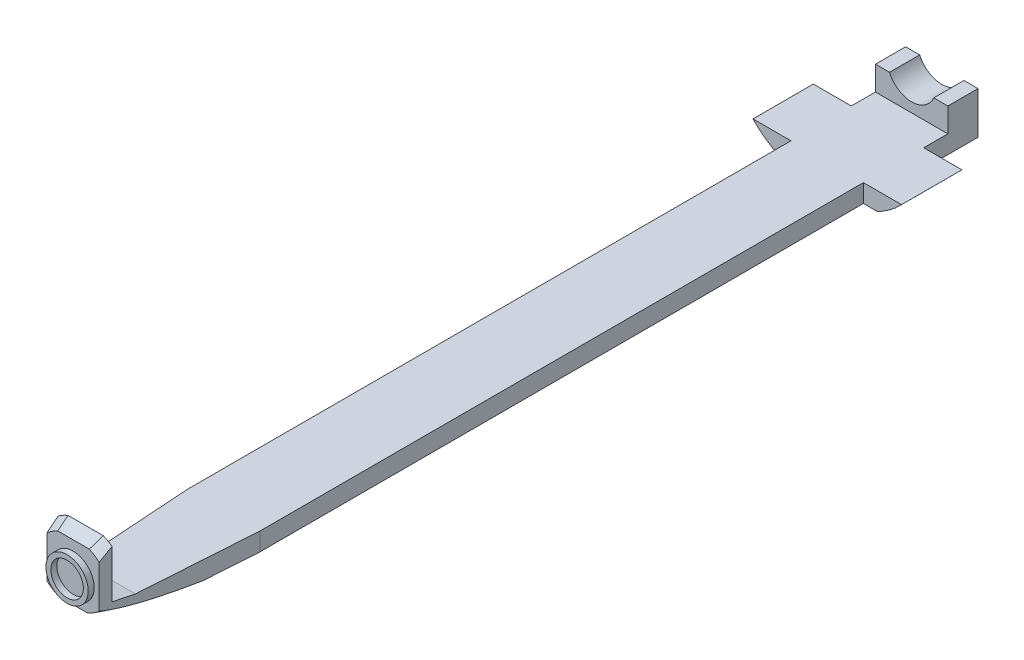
ISO-10303-21;
HEADER;
FILE_DESCRIPTION(('STEP AP214'),'2;1');
FILE_NAME('part.step','',(''),(''),'','','');
FILE_SCHEMA(('AUTOMOTIVE_DESIGN { 1 0 10303 214 1 1 1 1 }'));
ENDSEC;
DATA;
#1=APPLICATION_CONTEXT('core data for automotive mechanical design processes');
#2=APPLICATION_PROTOCOL_DEFINITION('international standard','automotive_design',2000,#1);
#3=PRODUCT_CONTEXT('',#1,'mechanical');
#4=PRODUCT('Part','Part','',(#3));
#5=PRODUCT_RELATED_PRODUCT_CATEGORY('part','',(#4));
#6=PRODUCT_DEFINITION_FORMATION('','',#4);
#7=PRODUCT_DEFINITION_CONTEXT('part definition',#1,'design');
#8=PRODUCT_DEFINITION('design','',#6,#7);
#9=PRODUCT_DEFINITION_SHAPE('','',#8);
#10=(LENGTH_UNIT() NAMED_UNIT(*) SI_UNIT(.MILLI.,.METRE.));
#11=(NAMED_UNIT(*) PLANE_ANGLE_UNIT() SI_UNIT($,.RADIAN.));
#12=(NAMED_UNIT(*) SI_UNIT($,.STERADIAN.) SOLID_ANGLE_UNIT());
#13=UNCERTAINTY_MEASURE_WITH_UNIT(LENGTH_MEASURE(1.E-05),#10,'distance_accuracy_value','');
#14=(GEOMETRIC_REPRESENTATION_CONTEXT(3) GLOBAL_UNCERTAINTY_ASSIGNED_CONTEXT((#13)) GLOBAL_UNIT_ASSIGNED_CONTEXT((#10,
#11,#12)) REPRESENTATION_CONTEXT('',''));
#15=CARTESIAN_POINT('',(0.,0.,0.));
#16=DIRECTION('',(0.,0.,1.));
#17=DIRECTION('',(1.,0.,0.));
#18=AXIS2_PLACEMENT_3D('',#15,#16,#17);
#19=CARTESIAN_POINT('',(-20.,-3.59452748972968,-8.99999982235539));
#20=DIRECTION('',(0.,1.,0.));
#21=DIRECTION('',(0.,0.,1.));
#22=AXIS2_PLACEMENT_3D('',#19,#20,#21);
#23=PLANE('',#22);
#24=DIRECTION('',(0.,0.,-1.));
#25=VECTOR('',#24,1.);
#26=CARTESIAN_POINT('',(3.66844409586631,-3.59452748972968,-4.00000000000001));
#27=LINE('',#26,#25);
#28=CARTESIAN_POINT('',(3.66844409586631,-3.59452748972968,-8.99999982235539));
#29=VERTEX_POINT('',#28);
#30=CARTESIAN_POINT('',(3.66844409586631,-3.59452748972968,-14.));
#31=VERTEX_POINT('',#30);
#32=EDGE_CURVE('E273',#29,#31,#27,.T.);
#33=ORIENTED_EDGE('',*,*,#32,.F.);
#34=DIRECTION('',(1.,0.,0.));
#35=VECTOR('',#34,1.);
#36=CARTESIAN_POINT('',(-20.,-3.59452748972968,-8.99999982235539));
#37=LINE('',#36,#35);
#38=CARTESIAN_POINT('',(6.,-3.59452748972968,-8.99999982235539));
#39=VERTEX_POINT('',#38);
#40=EDGE_CURVE('E340',#29,#39,#37,.T.);
#41=ORIENTED_EDGE('',*,*,#40,.T.);
#42=DIRECTION('',(0.,0.,1.));
#43=VECTOR('',#42,1.);
#44=CARTESIAN_POINT('',(6.,-3.59452748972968,-8.99999982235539));
#45=LINE('',#44,#43);
#46=CARTESIAN_POINT('',(6.,-3.59452748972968,-14.));
#47=VERTEX_POINT('',#46);
#48=EDGE_CURVE('E295',#47,#39,#45,.T.);
#49=ORIENTED_EDGE('',*,*,#48,.F.);
#50=DIRECTION('',(1.,0.,0.));
#51=VECTOR('',#50,1.);
#52=CARTESIAN_POINT('',(-20.,-3.59452748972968,-14.));
#53=LINE('',#52,#51);
#54=EDGE_CURVE('E286',#31,#47,#53,.T.);
#55=ORIENTED_EDGE('',*,*,#54,.F.);
#56=EDGE_LOOP('',(#33,#41,#49,#55));
#57=FACE_BOUND('',#56,.T.);
#58=ADVANCED_FACE('F87',(#57),#23,.T.);
#59=CARTESIAN_POINT('',(-20.,-10.5943482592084,-14.));
#60=DIRECTION('',(0.,-0.999999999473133,-3.24612670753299E-05));
#61=DIRECTION('',(0.,3.24612670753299E-05,-0.999999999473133));
#62=AXIS2_PLACEMENT_3D('',#59,#60,#61);
#63=PLANE('',#62);
#64=DIRECTION('',(-1.,0.,0.));
#65=VECTOR('',#64,1.);
#66=CARTESIAN_POINT('',(-20.,-10.5946404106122,-5.));
#67=LINE('',#66,#65);
#68=CARTESIAN_POINT('',(8.35326270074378,-10.5946404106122,-5.));
#69=VERTEX_POINT('',#68);
#70=CARTESIAN_POINT('',(6.,-10.5946404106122,-5.));
#71=VERTEX_POINT('',#70);
#72=EDGE_CURVE('E671',#69,#71,#67,.T.);
#73=ORIENTED_EDGE('',*,*,#72,.F.);
#74=DIRECTION('',(-5.58494707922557E-05,-3.24612670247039E-05,0.999999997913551));
#75=VECTOR('',#74,1.);
#76=CARTESIAN_POINT('',(8.35376525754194,-10.5943483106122,-13.9984164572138));
#77=LINE('',#76,#75);
#78=CARTESIAN_POINT('',(8.3527042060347,-10.5949650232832,5.));
#79=VERTEX_POINT('',#78);
#80=EDGE_CURVE('E643',#69,#79,#77,.T.);
#81=ORIENTED_EDGE('',*,*,#80,.T.);
#82=DIRECTION('',(1.,0.,0.));
#83=VECTOR('',#82,1.);
#84=CARTESIAN_POINT('',(-20.,-10.5949650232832,5.));
#85=LINE('',#84,#83);
#86=CARTESIAN_POINT('',(6.,-10.5949650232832,5.));
#87=VERTEX_POINT('',#86);
#88=EDGE_CURVE('E765',#87,#79,#85,.T.);
#89=ORIENTED_EDGE('',*,*,#88,.F.);
#90=DIRECTION('',(0.,3.24612670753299E-05,-0.999999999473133));
#91=VECTOR('',#90,1.);
#92=CARTESIAN_POINT('',(6.,-10.5943482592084,-14.));
#93=LINE('',#92,#91);
#94=CARTESIAN_POINT('',(6.,-10.5982111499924,105.));
#95=VERTEX_POINT('',#94);
#96=EDGE_CURVE('E702',#95,#87,#93,.T.);
#97=ORIENTED_EDGE('',*,*,#96,.F.);
#98=DIRECTION('',(0.0665190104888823,3.23893704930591E-05,-0.997785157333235));
#99=VECTOR('',#98,1.);
#100=CARTESIAN_POINT('',(13.7831858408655,-10.5944213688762,-11.7477876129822));
#101=LINE('',#100,#99);
#102=CARTESIAN_POINT('',(5.40938243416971,-10.5984987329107,113.859263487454));
#103=VERTEX_POINT('',#102);
#104=EDGE_CURVE('E445',#103,#95,#101,.T.);
#105=ORIENTED_EDGE('',*,*,#104,.F.);
#106=CARTESIAN_POINT('',(3.16997285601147,-10.5986731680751,119.232903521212));
#107=CARTESIAN_POINT('',(3.23155638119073,-10.5986696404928,119.124233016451));
#108=CARTESIAN_POINT('',(3.29186058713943,-10.5986660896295,119.014845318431));
#109=CARTESIAN_POINT('',(3.41012550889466,-10.5986589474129,118.794822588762));
#110=CARTESIAN_POINT('',(3.46808644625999,-10.5986553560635,118.684187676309));
#111=CARTESIAN_POINT('',(3.58179081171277,-10.598648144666,118.462033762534));
#112=CARTESIAN_POINT('',(3.63753798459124,-10.59864452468,118.350516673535));
#113=CARTESIAN_POINT('',(3.74709768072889,-10.5986372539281,118.126534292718));
#114=CARTESIAN_POINT('',(3.80091015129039,-10.5986336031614,118.014068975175));
#115=CARTESIAN_POINT('',(3.9596010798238,-10.5986226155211,117.675584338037));
#116=CARTESIAN_POINT('',(4.06181602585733,-10.5986152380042,117.448312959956));
#117=CARTESIAN_POINT('',(4.26008031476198,-10.5986003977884,116.991146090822));
#118=CARTESIAN_POINT('',(4.35613042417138,-10.5985929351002,116.761250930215));
#119=CARTESIAN_POINT('',(4.54234150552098,-10.5985779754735,116.300405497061));
#120=CARTESIAN_POINT('',(4.63252908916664,-10.5985704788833,116.069465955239));
#121=CARTESIAN_POINT('',(4.80810993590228,-10.5985554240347,115.605687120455));
#122=CARTESIAN_POINT('',(4.89350157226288,-10.5985478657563,115.372847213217));
#123=CARTESIAN_POINT('',(5.05992306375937,-10.5985326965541,114.90554560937));
#124=CARTESIAN_POINT('',(5.14095173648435,-10.5985250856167,114.671083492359));
#125=CARTESIAN_POINT('',(5.29898996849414,-10.5985098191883,114.200786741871));
#126=CARTESIAN_POINT('',(5.37599913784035,-10.598502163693,113.964951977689));
#127=CARTESIAN_POINT('',(5.57168056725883,-10.598482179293,113.349313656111));
#128=CARTESIAN_POINT('',(5.68742717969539,-10.5984698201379,112.968578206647));
#129=CARTESIAN_POINT('',(5.91035892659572,-10.5984450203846,112.204598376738));
#130=CARTESIAN_POINT('',(6.0175435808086,-10.5984325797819,111.82135385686));
#131=CARTESIAN_POINT('',(6.22417384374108,-10.5984076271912,111.052665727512));
#132=CARTESIAN_POINT('',(6.32361714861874,-10.5983951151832,110.667221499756));
#133=CARTESIAN_POINT('',(6.51539284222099,-10.5983700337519,109.894564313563));
#134=CARTESIAN_POINT('',(6.60772503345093,-10.598357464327,109.507351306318));
#135=CARTESIAN_POINT('',(6.87500189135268,-10.5983196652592,108.342915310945));
#136=CARTESIAN_POINT('',(7.04008847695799,-10.5982943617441,107.563416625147));
#137=CARTESIAN_POINT('',(7.34744050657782,-10.5982435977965,105.999585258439));
#138=CARTESIAN_POINT('',(7.48969461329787,-10.5982181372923,105.215250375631));
#139=CARTESIAN_POINT('',(7.75389885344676,-10.5981671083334,103.643255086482));
#140=CARTESIAN_POINT('',(7.87585077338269,-10.5981415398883,102.855594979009));
#141=CARTESIAN_POINT('',(8.10262615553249,-10.5980900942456,101.270763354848));
#142=CARTESIAN_POINT('',(8.20728961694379,-10.5980642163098,100.473569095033));
#143=CARTESIAN_POINT('',(8.4000161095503,-10.5980124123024,98.8776977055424));
#144=CARTESIAN_POINT('',(8.48808954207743,-10.5979864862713,98.0790218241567));
#145=CARTESIAN_POINT('',(8.64936098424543,-10.5979345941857,96.4804371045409));
#146=CARTESIAN_POINT('',(8.72256372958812,-10.5979086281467,95.680528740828));
#147=CARTESIAN_POINT('',(8.85562097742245,-10.5978566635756,94.0797110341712));
#148=CARTESIAN_POINT('',(8.91547714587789,-10.597830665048,93.2788018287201));
#149=CARTESIAN_POINT('',(9.02322356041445,-10.5977786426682,91.6762032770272));
#150=CARTESIAN_POINT('',(9.07111405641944,-10.5977526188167,90.8745139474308));
#151=CARTESIAN_POINT('',(9.16602972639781,-10.5976945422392,89.0854101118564));
#152=CARTESIAN_POINT('',(9.2103022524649,-10.5976624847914,88.0978501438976));
#153=CARTESIAN_POINT('',(9.28487393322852,-10.5975983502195,86.1221240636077));
#154=CARTESIAN_POINT('',(9.31517179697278,-10.5975662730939,85.1339579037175));
#155=CARTESIAN_POINT('',(9.36386954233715,-10.597502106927,83.1572585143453));
#156=CARTESIAN_POINT('',(9.38226844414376,-10.597470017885,82.1687252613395));
#157=CARTESIAN_POINT('',(9.40914449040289,-10.5974058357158,80.1915329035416));
#158=CARTESIAN_POINT('',(9.41762165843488,-10.5973737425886,79.2028737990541));
#159=CARTESIAN_POINT('',(9.42654412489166,-10.5973096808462,77.229391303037));
#160=CARTESIAN_POINT('',(9.42702070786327,-10.597277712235,76.2445680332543));
#161=CARTESIAN_POINT('',(9.42185887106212,-10.5972137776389,74.2750024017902));
#162=CARTESIAN_POINT('',(9.41622083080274,-10.5971818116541,73.2902600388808));
#163=CARTESIAN_POINT('',(9.40063960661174,-10.5971178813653,71.3208270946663));
#164=CARTESIAN_POINT('',(9.39069648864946,-10.5970859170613,70.3361365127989));
#165=CARTESIAN_POINT('',(9.36830265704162,-10.5970219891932,68.3667781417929));
#166=CARTESIAN_POINT('',(9.35585192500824,-10.5969900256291,67.3821103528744));
#167=CARTESIAN_POINT('',(9.33024878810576,-10.596926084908,65.4123560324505));
#168=CARTESIAN_POINT('',(9.3170960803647,-10.5968941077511,64.4272695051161));
#169=CARTESIAN_POINT('',(9.29190148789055,-10.5968301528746,62.4570791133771));
#170=CARTESIAN_POINT('',(9.2798596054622,-10.5967981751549,61.4719752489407));
#171=CARTESIAN_POINT('',(9.26408468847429,-10.5967502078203,59.994296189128));
#172=CARTESIAN_POINT('',(9.25920770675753,-10.5967342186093,59.5017334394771));
#173=CARTESIAN_POINT('',(9.25027190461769,-10.5967022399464,58.5166005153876));
#174=CARTESIAN_POINT('',(9.24621308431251,-10.5966862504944,58.024030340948));
#175=CARTESIAN_POINT('',(9.2351783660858,-10.5966382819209,56.5463131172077));
#176=CARTESIAN_POINT('',(9.22934418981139,-10.5966063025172,55.5611573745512));
#177=CARTESIAN_POINT('',(9.22042753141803,-10.5965423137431,53.5899227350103));
#178=CARTESIAN_POINT('',(9.21734759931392,-10.5965103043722,52.6038438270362));
#179=CARTESIAN_POINT('',(9.21362665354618,-10.5964462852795,50.6316751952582));
#180=CARTESIAN_POINT('',(9.21298565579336,-10.5964142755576,49.6455854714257));
#181=CARTESIAN_POINT('',(9.21381456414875,-10.5963502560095,47.6734028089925));
#182=CARTESIAN_POINT('',(9.21528447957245,-10.5963182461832,46.687309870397));
#183=CARTESIAN_POINT('',(9.2199944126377,-10.5962542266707,44.7151283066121));
#184=CARTESIAN_POINT('',(9.22323443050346,-10.5962222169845,43.7290396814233));
#185=CARTESIAN_POINT('',(9.23244856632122,-10.5961475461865,41.4287352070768));
#186=CARTESIAN_POINT('',(9.23897372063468,-10.5961048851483,40.1145216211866));
#187=CARTESIAN_POINT('',(9.25368897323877,-10.5960195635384,37.4861088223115));
#188=CARTESIAN_POINT('',(9.26187906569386,-10.5959769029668,36.1719096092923));
#189=CARTESIAN_POINT('',(9.27903969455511,-10.595891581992,33.5435163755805));
#190=CARTESIAN_POINT('',(9.28801023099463,-10.5958489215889,32.2293223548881));
#191=CARTESIAN_POINT('',(9.30582323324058,-10.5957636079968,29.6011565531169));
#192=CARTESIAN_POINT('',(9.31466572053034,-10.5957209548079,28.2871847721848));
#193=CARTESIAN_POINT('',(9.33129941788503,-10.5956356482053,25.659234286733));
#194=CARTESIAN_POINT('',(9.33909062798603,-10.5955929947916,24.3452555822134));
#195=CARTESIAN_POINT('',(9.35268349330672,-10.5955076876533,21.717288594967));
#196=CARTESIAN_POINT('',(9.3584851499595,-10.5954650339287,20.4033003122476));
#197=CARTESIAN_POINT('',(9.36887156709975,-10.5953627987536,17.2538491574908));
#198=CARTESIAN_POINT('',(9.37205967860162,-10.5953032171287,15.4183809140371));
#199=CARTESIAN_POINT('',(9.37011316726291,-10.5951840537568,11.7474406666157));
#200=CARTESIAN_POINT('',(9.36497852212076,-10.5951244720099,9.91196866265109));
#201=CARTESIAN_POINT('',(9.34379875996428,-10.5950053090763,6.24104191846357));
#202=CARTESIAN_POINT('',(9.32775341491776,-10.5949457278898,4.40558717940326));
#203=CARTESIAN_POINT('',(9.29359330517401,-10.5948563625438,1.65260327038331));
#204=CARTESIAN_POINT('',(9.28052529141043,-10.5948265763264,0.735010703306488));
#205=CARTESIAN_POINT('',(9.25070576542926,-10.5947670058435,-1.10011430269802));
#206=CARTESIAN_POINT('',(9.23395425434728,-10.594737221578,-2.01764674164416));
#207=CARTESIAN_POINT('',(9.1775011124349,-10.5946478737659,-4.77009049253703));
#208=CARTESIAN_POINT('',(9.13160050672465,-10.5945883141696,-6.60488008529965));
#209=CARTESIAN_POINT('',(9.01937463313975,-10.5944692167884,-10.2737875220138));
#210=CARTESIAN_POINT('',(8.95305018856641,-10.5944096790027,-12.1079053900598));
#211=CARTESIAN_POINT('',(8.87339830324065,-10.5943495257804,-13.9609820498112));
#212=CARTESIAN_POINT('',(8.87255831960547,-10.5943488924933,-13.980491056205));
#213=CARTESIAN_POINT('',(8.87171691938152,-10.5943482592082,-14.));
#214=B_SPLINE_CURVE_WITH_KNOTS('',3,(#106,#107,#108,#109,#110,#111,#112,#113,#114,#115,#116,
#117,#118,#119,#120,#121,#122,#123,#124,#125,#126,#127,#128,#129,#130,#131,#132,#133,#134,#135,
#136,#137,#138,#139,#140,#141,#142,#143,#144,#145,#146,#147,#148,#149,#150,#151,#152,#153,#154,
#155,#156,#157,#158,#159,#160,#161,#162,#163,#164,#165,#166,#167,#168,#169,#170,#171,#172,#173,
#174,#175,#176,#177,#178,#179,#180,#181,#182,#183,#184,#185,#186,#187,#188,#189,#190,#191,#192,
#193,#194,#195,#196,#197,#198,#199,#200,#201,#202,#203,#204,#205,#206,#207,#208,#209,#210,#211,
#212,#213),.UNSPECIFIED.,.F.,.F.,(4,2,2,2,2,2,2,2,2,2,2,2,2,2,2,2,2,2,2,2,2,2,2,2,2,2,2,2,2,2,2,
2,2,2,2,2,2,2,2,2,2,2,2,2,2,2,2,2,2,2,2,2,2,4),(0.,0.374703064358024,0.749370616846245,
1.1233747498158,1.49738906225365,2.24486824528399,2.99225430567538,3.73596894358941,
4.47993433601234,5.22410034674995,5.96833841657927,7.1620379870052,8.35580446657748,
9.54992486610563,10.7440784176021,13.1340026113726,15.5251098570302,17.9160065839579,
20.3279216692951,22.7383195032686,25.1479485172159,27.557276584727,29.9665543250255,
32.932089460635,35.8978984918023,38.8639517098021,41.8299978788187,44.7844432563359,
47.7387052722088,50.6929220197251,53.6471604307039,56.6026839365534,59.5582135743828,
61.0359735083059,62.5137336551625,65.4692479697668,68.4274958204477,71.3857629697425,
74.3440431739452,77.302323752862,81.2450113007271,85.1876850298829,89.1303589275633,
93.0723634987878,97.0143679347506,100.956369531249,106.462768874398,111.969182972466,
117.475712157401,120.228762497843,122.981811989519,128.487815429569,133.993596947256,
134.052178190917),.UNSPECIFIED.);
#215=CARTESIAN_POINT('',(3.1699728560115,-10.5986731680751,119.232903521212));
#216=VERTEX_POINT('',#215);
#217=EDGE_CURVE('E377',#216,#103,#214,.T.);
#218=ORIENTED_EDGE('',*,*,#217,.F.);
#219=DIRECTION('',(1.,0.,0.));
#220=VECTOR('',#219,1.);
#221=CARTESIAN_POINT('',(-20.,-10.5986731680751,119.232903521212));
#222=LINE('',#221,#220);
#223=CARTESIAN_POINT('',(-3.1392727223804,-10.5986731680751,119.232903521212));
#224=VERTEX_POINT('',#223);
#225=EDGE_CURVE('E303',#224,#216,#222,.T.);
#226=ORIENTED_EDGE('',*,*,#225,.F.);
#227=CARTESIAN_POINT('',(-8.87270919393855,-10.5943482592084,-14.));
#228=CARTESIAN_POINT('',(-8.90242375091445,-10.5943705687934,-13.312732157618));
#229=CARTESIAN_POINT('',(-8.93038920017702,-10.5943928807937,-12.625389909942));
#230=CARTESIAN_POINT('',(-8.9830417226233,-10.5944375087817,-11.2505825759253));
#231=CARTESIAN_POINT('',(-9.00772880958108,-10.5944598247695,-10.5631174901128));
#232=CARTESIAN_POINT('',(-9.05404340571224,-10.5945044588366,-9.18812288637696));
#233=CARTESIAN_POINT('',(-9.07567108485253,-10.5945267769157,-8.50059337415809));
#234=CARTESIAN_POINT('',(-9.11607632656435,-10.5945714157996,-7.12545038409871));
#235=CARTESIAN_POINT('',(-9.13485388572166,-10.5945937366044,-6.43783690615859));
#236=CARTESIAN_POINT('',(-9.19885963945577,-10.5946755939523,-3.9161439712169));
#237=CARTESIAN_POINT('',(-9.23599560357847,-10.5947351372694,-2.08185583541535));
#238=CARTESIAN_POINT('',(-9.29508741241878,-10.5948542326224,1.5869890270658));
#239=CARTESIAN_POINT('',(-9.31704293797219,-10.5949137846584,3.42154575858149));
#240=CARTESIAN_POINT('',(-9.34858406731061,-10.5950328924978,7.09077527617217));
#241=CARTESIAN_POINT('',(-9.35816957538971,-10.5950924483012,8.92544806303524));
#242=CARTESIAN_POINT('',(-9.36772858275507,-10.5952115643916,12.5949317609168));
#243=CARTESIAN_POINT('',(-9.36770146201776,-10.5952711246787,14.4297426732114));
#244=CARTESIAN_POINT('',(-9.36075160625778,-10.5953902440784,18.0993283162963));
#245=CARTESIAN_POINT('',(-9.35382894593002,-10.595449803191,19.9341030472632));
#246=CARTESIAN_POINT('',(-9.33575107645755,-10.5955689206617,23.6036292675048));
#247=CARTESIAN_POINT('',(-9.32459586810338,-10.5956284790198,25.4383807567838));
#248=CARTESIAN_POINT('',(-9.30663637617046,-10.595717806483,28.1901976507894));
#249=CARTESIAN_POINT('',(-9.30044655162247,-10.5957475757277,29.1072673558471));
#250=CARTESIAN_POINT('',(-9.28797367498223,-10.5958071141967,30.941406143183));
#251=CARTESIAN_POINT('',(-9.28169062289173,-10.5958368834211,31.8584752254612));
#252=CARTESIAN_POINT('',(-9.26934342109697,-10.5958964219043,33.6926144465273));
#253=CARTESIAN_POINT('',(-9.26327927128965,-10.595926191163,34.6096845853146));
#254=CARTESIAN_POINT('',(-9.25167567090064,-10.5959857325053,36.443911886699));
#255=CARTESIAN_POINT('',(-9.24613626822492,-10.596015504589,37.3610690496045));
#256=CARTESIAN_POINT('',(-9.23588362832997,-10.5960750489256,39.1953885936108));
#257=CARTESIAN_POINT('',(-9.23117039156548,-10.5961048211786,40.1125509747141));
#258=CARTESIAN_POINT('',(-9.22286507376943,-10.5961643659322,41.9468833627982));
#259=CARTESIAN_POINT('',(-9.21927299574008,-10.5961941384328,42.8640533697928));
#260=CARTESIAN_POINT('',(-9.21292049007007,-10.5962596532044,44.8822978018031));
#261=CARTESIAN_POINT('',(-9.21047122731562,-10.5962953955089,45.983373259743));
#262=CARTESIAN_POINT('',(-9.20809543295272,-10.5963668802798,48.1855291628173));
#263=CARTESIAN_POINT('',(-9.2081689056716,-10.5964026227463,49.286609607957));
#264=CARTESIAN_POINT('',(-9.21131570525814,-10.5964741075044,51.4887651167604));
#265=CARTESIAN_POINT('',(-9.21438902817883,-10.5965098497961,52.5898401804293));
#266=CARTESIAN_POINT('',(-9.22400651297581,-10.5965813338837,54.7919750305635));
#267=CARTESIAN_POINT('',(-9.23055067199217,-10.5966170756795,55.8930348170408));
#268=CARTESIAN_POINT('',(-9.24330392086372,-10.5966706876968,57.5446036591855));
#269=CARTESIAN_POINT('',(-9.24804451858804,-10.596688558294,58.0951242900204));
#270=CARTESIAN_POINT('',(-9.25857728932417,-10.5967242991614,59.1961554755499));
#271=CARTESIAN_POINT('',(-9.26436946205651,-10.5967421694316,59.7466660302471));
#272=CARTESIAN_POINT('',(-9.2832949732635,-10.5967957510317,61.3972978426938));
#273=CARTESIAN_POINT('',(-9.2979840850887,-10.5968314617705,62.4974008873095));
#274=CARTESIAN_POINT('',(-9.32878514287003,-10.5969028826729,64.6975892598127));
#275=CARTESIAN_POINT('',(-9.34489709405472,-10.5969385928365,65.7976745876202));
#276=CARTESIAN_POINT('',(-9.3759745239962,-10.5970100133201,67.9978500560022));
#277=CARTESIAN_POINT('',(-9.39094001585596,-10.5970457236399,69.0979401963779));
#278=CARTESIAN_POINT('',(-9.41714826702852,-10.5971171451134,71.2981461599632));
#279=CARTESIAN_POINT('',(-9.42839109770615,-10.5971528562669,72.398261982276));
#280=CARTESIAN_POINT('',(-9.44458170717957,-10.5972242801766,74.5985429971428));
#281=CARTESIAN_POINT('',(-9.44952950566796,-10.5972599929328,75.6987081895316));
#282=CARTESIAN_POINT('',(-9.4503310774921,-10.5973180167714,77.4861873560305));
#283=CARTESIAN_POINT('',(-9.44890076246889,-10.5973403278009,78.1734996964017));
#284=CARTESIAN_POINT('',(-9.441912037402,-10.5973849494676,79.5481122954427));
#285=CARTESIAN_POINT('',(-9.43635358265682,-10.5974072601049,80.2354125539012));
#286=CARTESIAN_POINT('',(-9.42044430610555,-10.5974518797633,81.6099632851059));
#287=CARTESIAN_POINT('',(-9.41009345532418,-10.5974741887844,82.297213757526));
#288=CARTESIAN_POINT('',(-9.38391657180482,-10.5975188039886,83.6716272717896));
#289=CARTESIAN_POINT('',(-9.3680904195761,-10.5975411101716,84.3587903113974));
#290=CARTESIAN_POINT('',(-9.3302030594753,-10.5975857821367,85.7349523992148));
#291=CARTESIAN_POINT('',(-9.30812380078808,-10.5976081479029,86.423950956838));
#292=CARTESIAN_POINT('',(-9.25701099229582,-10.5976528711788,87.8016937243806));
#293=CARTESIAN_POINT('',(-9.22797743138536,-10.5976752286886,88.490437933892));
#294=CARTESIAN_POINT('',(-9.16218559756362,-10.5977199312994,89.8675440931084));
#295=CARTESIAN_POINT('',(-9.1254275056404,-10.5977422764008,90.5559060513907));
#296=CARTESIAN_POINT('',(-9.04337587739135,-10.5977869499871,91.9321180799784));
#297=CARTESIAN_POINT('',(-8.99808242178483,-10.5978092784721,92.6199681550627));
#298=CARTESIAN_POINT('',(-8.89856350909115,-10.5978537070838,93.9886335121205));
#299=CARTESIAN_POINT('',(-8.84442449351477,-10.5978758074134,94.6694550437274));
#300=CARTESIAN_POINT('',(-8.7260326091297,-10.5979199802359,96.0302405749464));
#301=CARTESIAN_POINT('',(-8.66177947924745,-10.5979420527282,96.7102045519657));
#302=CARTESIAN_POINT('',(-8.52219583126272,-10.5979861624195,98.069045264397));
#303=CARTESIAN_POINT('',(-8.44686458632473,-10.5980081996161,98.7479219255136));
#304=CARTESIAN_POINT('',(-8.28406666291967,-10.5980522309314,100.104348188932));
#305=CARTESIAN_POINT('',(-8.19659782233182,-10.5980742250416,100.781897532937));
#306=CARTESIAN_POINT('',(-8.00834025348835,-10.5981181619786,102.135416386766));
#307=CARTESIAN_POINT('',(-7.90754643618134,-10.5981401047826,102.811385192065));
#308=CARTESIAN_POINT('',(-7.69204243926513,-10.5981837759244,104.156715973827));
#309=CARTESIAN_POINT('',(-7.57742453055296,-10.59820550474,104.826092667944));
#310=CARTESIAN_POINT('',(-7.33228064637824,-10.5982488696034,106.161988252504));
#311=CARTESIAN_POINT('',(-7.20175360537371,-10.5982705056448,106.828506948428));
#312=CARTESIAN_POINT('',(-6.92307670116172,-10.598313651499,108.157655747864));
#313=CARTESIAN_POINT('',(-6.77493211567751,-10.5983351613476,108.820286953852));
#314=CARTESIAN_POINT('',(-6.45885307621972,-10.5983780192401,110.140564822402));
#315=CARTESIAN_POINT('',(-6.2909269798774,-10.5983993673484,110.798213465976));
#316=CARTESIAN_POINT('',(-6.02210405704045,-10.5984312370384,111.779989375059));
#317=CARTESIAN_POINT('',(-5.92967922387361,-10.598441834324,112.106448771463));
#318=CARTESIAN_POINT('',(-5.73873345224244,-10.5984629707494,112.757576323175));
#319=CARTESIAN_POINT('',(-5.64021271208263,-10.598473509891,113.082244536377));
#320=CARTESIAN_POINT('',(-5.45959672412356,-10.5984921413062,113.65620288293));
#321=CARTESIAN_POINT('',(-5.37883430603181,-10.5985002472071,113.905912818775));
#322=CARTESIAN_POINT('',(-5.21303568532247,-10.5985164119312,114.403882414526));
#323=CARTESIAN_POINT('',(-5.12799995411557,-10.5985244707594,114.652142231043));
#324=CARTESIAN_POINT('',(-4.95329586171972,-10.5985405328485,115.146950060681));
#325=CARTESIAN_POINT('',(-4.86362882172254,-10.5985485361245,115.393498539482));
#326=CARTESIAN_POINT('',(-4.67920356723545,-10.5985644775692,115.884589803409));
#327=CARTESIAN_POINT('',(-4.58444715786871,-10.5985724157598,116.129133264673));
#328=CARTESIAN_POINT('',(-4.3887711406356,-10.598588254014,116.617045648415));
#329=CARTESIAN_POINT('',(-4.28782532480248,-10.5985961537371,116.860404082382));
#330=CARTESIAN_POINT('',(-4.07936240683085,-10.5986118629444,117.344341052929));
#331=CARTESIAN_POINT('',(-3.97184454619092,-10.598619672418,117.584919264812));
#332=CARTESIAN_POINT('',(-3.80480640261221,-10.5986313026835,117.943200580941));
#333=CARTESIAN_POINT('',(-3.74814492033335,-10.598635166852,118.062239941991));
#334=CARTESIAN_POINT('',(-3.63273546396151,-10.5986428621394,118.299300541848));
#335=CARTESIAN_POINT('',(-3.57398755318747,-10.5986466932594,118.417321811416));
#336=CARTESIAN_POINT('',(-3.45409582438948,-10.5986543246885,118.652415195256));
#337=CARTESIAN_POINT('',(-3.39294783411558,-10.5986581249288,118.769485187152));
#338=CARTESIAN_POINT('',(-3.26809274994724,-10.5986656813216,119.002267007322));
#339=CARTESIAN_POINT('',(-3.20438538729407,-10.5986694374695,119.117978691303));
#340=CARTESIAN_POINT('',(-3.13927272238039,-10.5986731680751,119.232903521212));
#341=B_SPLINE_CURVE_WITH_KNOTS('',3,(#227,#228,#229,#230,#231,#232,#233,#234,#235,#236,#237,
#238,#239,#240,#241,#242,#243,#244,#245,#246,#247,#248,#249,#250,#251,#252,#253,#254,#255,#256,
#257,#258,#259,#260,#261,#262,#263,#264,#265,#266,#267,#268,#269,#270,#271,#272,#273,#274,#275,
#276,#277,#278,#279,#280,#281,#282,#283,#284,#285,#286,#287,#288,#289,#290,#291,#292,#293,#294,
#295,#296,#297,#298,#299,#300,#301,#302,#303,#304,#305,#306,#307,#308,#309,#310,#311,#312,#313,
#314,#315,#316,#317,#318,#319,#320,#321,#322,#323,#324,#325,#326,#327,#328,#329,#330,#331,#332,
#333,#334,#335,#336,#337,#338,#339,#340),.UNSPECIFIED.,.F.,.F.,(4,2,2,2,2,2,2,2,2,2,2,2,2,2,2,2,
2,2,2,2,2,2,2,2,2,2,2,2,2,2,2,2,2,2,2,2,2,2,2,2,2,2,2,2,2,2,2,2,2,2,2,2,2,2,2,2,4),(0.,
2.06372569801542,4.12744272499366,6.19104505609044,8.25464985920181,13.7585513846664,
19.2625686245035,24.7666284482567,30.2710432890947,35.7753985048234,41.2797526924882,
44.0310245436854,46.7822963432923,49.5335668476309,52.2850882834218,55.0366112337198,
57.7881415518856,61.0913737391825,64.3946115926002,67.6978450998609,71.001075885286,
72.6526982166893,74.304320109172,77.6049189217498,80.9055298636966,84.2061030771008,
87.5066130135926,90.8071126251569,92.8690440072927,94.9309977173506,96.9929638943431,
99.0549750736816,101.123000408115,103.191029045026,105.259009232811,107.326969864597,
109.375813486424,111.424710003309,113.473741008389,115.523137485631,117.573318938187,
119.610503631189,121.647824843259,123.684537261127,125.7203922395,126.738216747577,
127.756008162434,128.543310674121,129.330526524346,130.117519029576,130.904234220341,
131.694547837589,132.484952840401,132.880446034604,133.275927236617,133.672129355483,
134.068373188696),.UNSPECIFIED.);
#342=CARTESIAN_POINT('',(-5.41354634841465,-10.5984967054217,113.79680477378));
#343=VERTEX_POINT('',#342);
#344=EDGE_CURVE('E452',#343,#224,#341,.T.);
#345=ORIENTED_EDGE('',*,*,#344,.F.);
#346=DIRECTION('',(0.0665190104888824,-3.23893704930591E-05,0.997785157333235));
#347=VECTOR('',#346,1.);
#348=CARTESIAN_POINT('',(-13.9601769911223,-10.5943351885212,-14.4026548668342));
#349=LINE('',#348,#347);
#350=CARTESIAN_POINT('',(-6.,-10.5982111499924,105.));
#351=VERTEX_POINT('',#350);
#352=EDGE_CURVE('E740',#351,#343,#349,.T.);
#353=ORIENTED_EDGE('',*,*,#352,.F.);
#354=DIRECTION('',(0.,-3.24612670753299E-05,0.999999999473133));
#355=VECTOR('',#354,1.);
#356=CARTESIAN_POINT('',(-6.,-10.5943482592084,-14.));
#357=LINE('',#356,#355);
#358=CARTESIAN_POINT('',(-6.,-10.5949650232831,5.));
#359=VERTEX_POINT('',#358);
#360=EDGE_CURVE('E306',#359,#351,#357,.T.);
#361=ORIENTED_EDGE('',*,*,#360,.F.);
#362=DIRECTION('',(1.,0.,0.));
#363=VECTOR('',#362,1.);
#364=CARTESIAN_POINT('',(-20.,-10.5949650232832,5.));
#365=LINE('',#364,#363);
#366=CARTESIAN_POINT('',(-8.33024745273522,-10.5949650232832,5.));
#367=VERTEX_POINT('',#366);
#368=EDGE_CURVE('E585',#367,#359,#365,.T.);
#369=ORIENTED_EDGE('',*,*,#368,.F.);
#370=DIRECTION('',(-5.5021707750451E-05,3.24612670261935E-05,-0.999999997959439));
#371=VECTOR('',#370,1.);
#372=CARTESIAN_POINT('',(-8.33129290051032,-10.5943482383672,-14.0006420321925));
#373=LINE('',#372,#371);
#374=CARTESIAN_POINT('',(-8.33079766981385,-10.5946404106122,-5.));
#375=VERTEX_POINT('',#374);
#376=EDGE_CURVE('E580',#367,#375,#373,.T.);
#377=ORIENTED_EDGE('',*,*,#376,.T.);
#378=DIRECTION('',(-1.,0.,0.));
#379=VECTOR('',#378,1.);
#380=CARTESIAN_POINT('',(-20.,-10.5946404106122,-5.));
#381=LINE('',#380,#379);
#382=CARTESIAN_POINT('',(-6.,-10.5946404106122,-5.));
#383=VERTEX_POINT('',#382);
#384=EDGE_CURVE('E577',#383,#375,#381,.T.);
#385=ORIENTED_EDGE('',*,*,#384,.F.);
#386=DIRECTION('',(0.,-3.24612670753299E-05,0.999999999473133));
#387=VECTOR('',#386,1.);
#388=CARTESIAN_POINT('',(-6.,-10.5943482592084,-14.));
#389=LINE('',#388,#387);
#390=CARTESIAN_POINT('',(-6.,-10.5943482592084,-14.));
#391=VERTEX_POINT('',#390);
#392=EDGE_CURVE('E689',#391,#383,#389,.T.);
#393=ORIENTED_EDGE('',*,*,#392,.F.);
#394=DIRECTION('',(1.,0.,0.));
#395=VECTOR('',#394,1.);
#396=CARTESIAN_POINT('',(-20.,-10.5943482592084,-14.));
#397=LINE('',#396,#395);
#398=CARTESIAN_POINT('',(6.,-10.5943482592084,-14.));
#399=VERTEX_POINT('',#398);
#400=EDGE_CURVE('E297',#391,#399,#397,.T.);
#401=ORIENTED_EDGE('',*,*,#400,.T.);
#402=DIRECTION('',(0.,3.24612670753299E-05,-0.999999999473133));
#403=VECTOR('',#402,1.);
#404=CARTESIAN_POINT('',(6.,-10.5943482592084,-14.));
#405=LINE('',#404,#403);
#406=EDGE_CURVE('E700',#71,#399,#405,.T.);
#407=ORIENTED_EDGE('',*,*,#406,.F.);
#408=EDGE_LOOP('',(#73,#81,#89,#97,#105,#218,#226,#345,#353,#361,#369,#377,#385,#393,#401,#407));
#409=FACE_BOUND('',#408,.T.);
#410=ADVANCED_FACE('F442',(#409),#63,.T.);
#411=CARTESIAN_POINT('',(-20.,-7.59451056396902,-8.99999982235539));
#412=DIRECTION('',(0.,0.999999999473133,3.24612670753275E-05));
#413=DIRECTION('',(0.,-3.24612670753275E-05,0.999999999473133));
#414=AXIS2_PLACEMENT_3D('',#411,#412,#413);
#415=PLANE('',#414);
#416=DIRECTION('',(1.,0.,0.));
#417=VECTOR('',#416,1.);
#418=CARTESIAN_POINT('',(-20.,-7.59464040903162,-5.));
#419=LINE('',#418,#417);
#420=CARTESIAN_POINT('',(-12.2974328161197,-7.59464040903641,-5.));
#421=VERTEX_POINT('',#420);
#422=CARTESIAN_POINT('',(-6.,-7.59464040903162,-5.));
#423=VERTEX_POINT('',#422);
#424=EDGE_CURVE('E758',#421,#423,#419,.T.);
#425=ORIENTED_EDGE('',*,*,#424,.F.);
#426=CARTESIAN_POINT('',(-12.2975545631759,-7.59451056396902,-8.99999982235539));
#427=CARTESIAN_POINT('',(-12.2974605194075,-7.59461086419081,-5.91015673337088));
#428=CARTESIAN_POINT('',(-12.2973664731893,-7.59471116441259,-2.82031364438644));
#429=CARTESIAN_POINT('',(-12.2971736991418,-7.59491675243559,3.51301962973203));
#430=CARTESIAN_POINT('',(-12.2970749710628,-7.5950220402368,6.75650981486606));
#431=CARTESIAN_POINT('',(-12.2969762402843,-7.59512732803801,10.));
#432=B_SPLINE_CURVE_WITH_KNOTS('',3,(#426,#427,#428,#429,#430,#431),.UNSPECIFIED.,.F.,.F.,(4,2,
4),(0.,9.26952927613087,18.9999998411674),.UNSPECIFIED.);
#433=CARTESIAN_POINT('',(-12.297128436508,-7.59496502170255,4.99999999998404));
#434=VERTEX_POINT('',#433);
#435=EDGE_CURVE('E572',#421,#434,#432,.T.);
#436=ORIENTED_EDGE('',*,*,#435,.T.);
#437=DIRECTION('',(-1.,0.,0.));
#438=VECTOR('',#437,1.);
#439=CARTESIAN_POINT('',(-20.,-7.59496502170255,5.));
#440=LINE('',#439,#438);
#441=CARTESIAN_POINT('',(-6.,-7.59496502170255,5.));
#442=VERTEX_POINT('',#441);
#443=EDGE_CURVE('E752',#442,#434,#440,.T.);
#444=ORIENTED_EDGE('',*,*,#443,.F.);
#445=DIRECTION('',(0.,3.24612670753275E-05,-0.999999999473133));
#446=VECTOR('',#445,1.);
#447=CARTESIAN_POINT('',(-6.,-7.59451056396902,-8.99999982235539));
#448=LINE('',#447,#446);
#449=CARTESIAN_POINT('',(-6.,-7.59821114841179,105.));
#450=VERTEX_POINT('',#449);
#451=EDGE_CURVE('E540',#450,#442,#448,.T.);
#452=ORIENTED_EDGE('',*,*,#451,.F.);
#453=DIRECTION('',(-0.0665190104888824,3.23893704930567E-05,-0.997785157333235));
#454=VECTOR('',#453,1.);
#455=CARTESIAN_POINT('',(-13.6283185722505,-7.59449677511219,-9.42477858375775));
#456=LINE('',#455,#454);
#457=CARTESIAN_POINT('',(-4.70889830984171,-7.59883981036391,124.366525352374));
#458=VERTEX_POINT('',#457);
#459=EDGE_CURVE('E749',#458,#450,#456,.T.);
#460=ORIENTED_EDGE('',*,*,#459,.F.);
#461=DIRECTION('',(1.,0.,0.));
#462=VECTOR('',#461,1.);
#463=CARTESIAN_POINT('',(-20.,-7.59883981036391,124.366525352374));
#464=LINE('',#463,#462);
#465=CARTESIAN_POINT('',(4.70889830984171,-7.59883981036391,124.366525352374));
#466=VERTEX_POINT('',#465);
#467=EDGE_CURVE('E328',#458,#466,#464,.T.);
#468=ORIENTED_EDGE('',*,*,#467,.T.);
#469=DIRECTION('',(-0.0665190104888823,-3.23893704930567E-05,0.997785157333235));
#470=VECTOR('',#469,1.);
#471=CARTESIAN_POINT('',(13.4513274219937,-7.59458295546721,-6.76991132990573));
#472=LINE('',#471,#470);
#473=CARTESIAN_POINT('',(6.,-7.59821114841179,105.));
#474=VERTEX_POINT('',#473);
#475=EDGE_CURVE('E672',#474,#466,#472,.T.);
#476=ORIENTED_EDGE('',*,*,#475,.F.);
#477=DIRECTION('',(0.,-3.24612670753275E-05,0.999999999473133));
#478=VECTOR('',#477,1.);
#479=CARTESIAN_POINT('',(6.,-7.59451056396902,-8.99999982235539));
#480=LINE('',#479,#478);
#481=CARTESIAN_POINT('',(6.,-7.59496502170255,5.));
#482=VERTEX_POINT('',#481);
#483=EDGE_CURVE('E537',#482,#474,#480,.T.);
#484=ORIENTED_EDGE('',*,*,#483,.F.);
#485=DIRECTION('',(-1.,0.,0.));
#486=VECTOR('',#485,1.);
#487=CARTESIAN_POINT('',(-20.,-7.59496502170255,5.));
#488=LINE('',#487,#486);
#489=CARTESIAN_POINT('',(12.3270133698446,-7.59496502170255,5.00000000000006));
#490=VERTEX_POINT('',#489);
#491=EDGE_CURVE('E662',#490,#482,#488,.T.);
#492=ORIENTED_EDGE('',*,*,#491,.F.);
#493=CARTESIAN_POINT('',(12.3268613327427,-7.59512732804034,10.));
#494=CARTESIAN_POINT('',(12.3269557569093,-7.59502652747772,6.89474347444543));
#495=CARTESIAN_POINT('',(12.3270501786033,-7.59492572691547,3.78948694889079));
#496=CARTESIAN_POINT('',(12.3272427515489,-7.59472013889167,-2.54384632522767));
#497=CARTESIAN_POINT('',(12.3273409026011,-7.59461535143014,-5.77192307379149));
#498=CARTESIAN_POINT('',(12.3274390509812,-7.59451056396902,-8.99999982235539));
#499=B_SPLINE_CURVE_WITH_KNOTS('',3,(#493,#494,#495,#496,#497,#498),.UNSPECIFIED.,.F.,.F.,(4,2,
4),(0.,9.31576958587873,18.999999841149),.UNSPECIFIED.);
#500=CARTESIAN_POINT('',(12.3273174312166,-7.59464040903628,-5.));
#501=VERTEX_POINT('',#500);
#502=EDGE_CURVE('E593',#490,#501,#499,.T.);
#503=ORIENTED_EDGE('',*,*,#502,.T.);
#504=DIRECTION('',(1.,0.,0.));
#505=VECTOR('',#504,1.);
#506=CARTESIAN_POINT('',(-20.,-7.59464040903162,-5.));
#507=LINE('',#506,#505);
#508=CARTESIAN_POINT('',(6.,-7.59464040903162,-5.));
#509=VERTEX_POINT('',#508);
#510=EDGE_CURVE('E660',#509,#501,#507,.T.);
#511=ORIENTED_EDGE('',*,*,#510,.F.);
#512=DIRECTION('',(0.,-3.24612670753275E-05,0.999999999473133));
#513=VECTOR('',#512,1.);
#514=CARTESIAN_POINT('',(6.,-7.59451056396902,-8.99999982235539));
#515=LINE('',#514,#513);
#516=CARTESIAN_POINT('',(6.,-7.59451056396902,-8.99999982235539));
#517=VERTEX_POINT('',#516);
#518=EDGE_CURVE('E692',#517,#509,#515,.T.);
#519=ORIENTED_EDGE('',*,*,#518,.F.);
#520=DIRECTION('',(1.,0.,0.));
#521=VECTOR('',#520,1.);
#522=CARTESIAN_POINT('',(-20.,-7.59451056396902,-8.99999982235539));
#523=LINE('',#522,#521);
#524=CARTESIAN_POINT('',(-6.,-7.59451056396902,-8.99999982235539));
#525=VERTEX_POINT('',#524);
#526=EDGE_CURVE('E332',#525,#517,#523,.T.);
#527=ORIENTED_EDGE('',*,*,#526,.F.);
#528=DIRECTION('',(0.,3.24612670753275E-05,-0.999999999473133));
#529=VECTOR('',#528,1.);
#530=CARTESIAN_POINT('',(-6.,-7.59451056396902,-8.99999982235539));
#531=LINE('',#530,#529);
#532=EDGE_CURVE('E676',#423,#525,#531,.T.);
#533=ORIENTED_EDGE('',*,*,#532,.F.);
#534=EDGE_LOOP('',(#425,#436,#444,#452,#460,#468,#476,#484,#492,#503,#511,#519,#527,#533));
#535=FACE_BOUND('',#534,.T.);
#536=ADVANCED_FACE('F472',(#535),#415,.T.);
#537=CARTESIAN_POINT('',(-6.,20.,5.));
#538=DIRECTION('',(0.,0.,-1.));
#539=DIRECTION('',(-1.,0.,0.));
#540=AXIS2_PLACEMENT_3D('',#537,#538,#539);
#541=PLANE('',#540);
#542=CARTESIAN_POINT('',(-9.08190426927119,-10.1515085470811,5.));
#543=CARTESIAN_POINT('',(-9.41286563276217,-9.95539169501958,5.));
#544=CARTESIAN_POINT('',(-10.0624413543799,-9.53826678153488,5.));
#545=CARTESIAN_POINT('',(-10.9777324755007,-8.84631469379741,5.));
#546=CARTESIAN_POINT('',(-11.8465893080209,-8.07972940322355,5.));
#547=CARTESIAN_POINT('',(-12.3730609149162,-7.51917397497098,5.));
#548=CARTESIAN_POINT('',(-12.6281930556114,-7.23158150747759,5.));
#549=B_SPLINE_CURVE_WITH_KNOTS('',3,(#542,#543,#544,#545,#546,#547,#548),.UNSPECIFIED.,.F.,.F.,
(4,1,1,1,4),(0.000446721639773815,0.250243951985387,0.500041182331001,0.749838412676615,
0.999635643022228),.UNSPECIFIED.);
#550=CARTESIAN_POINT('',(-9.08190426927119,-10.1515085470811,5.));
#551=VERTEX_POINT('',#550);
#552=EDGE_CURVE('E606',#551,#434,#549,.T.);
#553=ORIENTED_EDGE('',*,*,#552,.F.);
#554=DIRECTION('',(-0.861279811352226,0.508130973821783,0.));
#555=VECTOR('',#554,1.);
#556=CARTESIAN_POINT('',(-19.9913338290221,-3.71525055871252,5.));
#557=LINE('',#556,#555);
#558=EDGE_CURVE('E587',#367,#551,#557,.T.);
#559=ORIENTED_EDGE('',*,*,#558,.F.);
#560=ORIENTED_EDGE('',*,*,#368,.T.);
#561=DIRECTION('',(0.,-1.,0.));
#562=VECTOR('',#561,1.);
#563=CARTESIAN_POINT('',(-6.,20.,5.));
#564=LINE('',#563,#562);
#565=EDGE_CURVE('E731',#442,#359,#564,.T.);
#566=ORIENTED_EDGE('',*,*,#565,.F.);
#567=ORIENTED_EDGE('',*,*,#443,.T.);
#568=EDGE_LOOP('',(#553,#559,#560,#566,#567));
#569=FACE_BOUND('',#568,.T.);
#570=ADVANCED_FACE('F497',(#569),#541,.F.);
#571=CARTESIAN_POINT('',(-6.,20.,-5.));
#572=DIRECTION('',(0.,0.,1.));
#573=DIRECTION('',(1.,0.,0.));
#574=AXIS2_PLACEMENT_3D('',#571,#572,#573);
#575=PLANE('',#574);
#576=CARTESIAN_POINT('',(-9.08190426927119,-10.1515085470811,-5.));
#577=CARTESIAN_POINT('',(-9.41286563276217,-9.95539169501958,-5.));
#578=CARTESIAN_POINT('',(-10.0624413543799,-9.53826678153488,-5.));
#579=CARTESIAN_POINT('',(-10.9777324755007,-8.84631469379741,-5.));
#580=CARTESIAN_POINT('',(-11.8465893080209,-8.07972940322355,-5.));
#581=CARTESIAN_POINT('',(-12.3730609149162,-7.51917397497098,-5.));
#582=CARTESIAN_POINT('',(-12.6281930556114,-7.23158150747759,-5.));
#583=B_SPLINE_CURVE_WITH_KNOTS('',3,(#576,#577,#578,#579,#580,#581,#582),.UNSPECIFIED.,.F.,.F.,
(4,1,1,1,4),(0.000446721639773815,0.250243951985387,0.500041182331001,0.749838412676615,
0.999635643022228),.UNSPECIFIED.);
#584=CARTESIAN_POINT('',(-9.08190426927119,-10.1515085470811,-5.));
#585=VERTEX_POINT('',#584);
#586=EDGE_CURVE('E99',#421,#585,#583,.F.);
#587=ORIENTED_EDGE('',*,*,#586,.F.);
#588=ORIENTED_EDGE('',*,*,#424,.T.);
#589=DIRECTION('',(0.,-1.,0.));
#590=VECTOR('',#589,1.);
#591=CARTESIAN_POINT('',(-6.,20.,-5.));
#592=LINE('',#591,#590);
#593=EDGE_CURVE('E723',#423,#383,#592,.T.);
#594=ORIENTED_EDGE('',*,*,#593,.T.);
#595=ORIENTED_EDGE('',*,*,#384,.T.);
#596=DIRECTION('',(0.861279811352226,-0.508130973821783,0.));
#597=VECTOR('',#596,1.);
#598=CARTESIAN_POINT('',(-19.9913338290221,-3.71525055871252,-5.));
#599=LINE('',#598,#597);
#600=EDGE_CURVE('E555',#585,#375,#599,.T.);
#601=ORIENTED_EDGE('',*,*,#600,.F.);
#602=EDGE_LOOP('',(#587,#588,#594,#595,#601));
#603=FACE_BOUND('',#602,.T.);
#604=ADVANCED_FACE('F494',(#603),#575,.F.);
#605=CARTESIAN_POINT('',(20.,20.,5.));
#606=DIRECTION('',(0.,0.,-1.));
#607=DIRECTION('',(-1.,0.,0.));
#608=AXIS2_PLACEMENT_3D('',#605,#606,#607);
#609=PLANE('',#608);
#610=CARTESIAN_POINT('',(12.6566453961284,-7.23286079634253,5.));
#611=CARTESIAN_POINT('',(12.4019893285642,-7.52003769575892,5.));
#612=CARTESIAN_POINT('',(11.8777844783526,-8.07901095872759,5.));
#613=CARTESIAN_POINT('',(11.0055444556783,-8.84883863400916,5.));
#614=CARTESIAN_POINT('',(10.0763828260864,-9.55073024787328,5.));
#615=CARTESIAN_POINT('',(9.42908855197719,-9.96569037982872,5.));
#616=CARTESIAN_POINT('',(9.09785726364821,-10.1618613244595,5.));
#617=B_SPLINE_CURVE_WITH_KNOTS('',3,(#610,#611,#612,#613,#614,#615,#616),.UNSPECIFIED.,.F.,.F.,
(4,1,1,1,4),(-9.39134240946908E-05,0.249812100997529,0.499718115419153,0.749624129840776,
0.9995301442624),.UNSPECIFIED.);
#618=CARTESIAN_POINT('',(9.09785726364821,-10.1618613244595,5.));
#619=VERTEX_POINT('',#618);
#620=EDGE_CURVE('E588',#490,#619,#617,.T.);
#621=ORIENTED_EDGE('',*,*,#620,.F.);
#622=ORIENTED_EDGE('',*,*,#491,.T.);
#623=DIRECTION('',(0.,-1.,0.));
#624=VECTOR('',#623,1.);
#625=CARTESIAN_POINT('',(6.,20.,5.));
#626=LINE('',#625,#624);
#627=EDGE_CURVE('E783',#482,#87,#626,.T.);
#628=ORIENTED_EDGE('',*,*,#627,.T.);
#629=ORIENTED_EDGE('',*,*,#88,.T.);
#630=DIRECTION('',(-0.864570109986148,-0.502512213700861,0.));
#631=VECTOR('',#630,1.);
#632=CARTESIAN_POINT('',(30.3510399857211,2.19108006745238,5.));
#633=LINE('',#632,#631);
#634=EDGE_CURVE('E647',#619,#79,#633,.T.);
#635=ORIENTED_EDGE('',*,*,#634,.F.);
#636=EDGE_LOOP('',(#621,#622,#628,#629,#635));
#637=FACE_BOUND('',#636,.T.);
#638=ADVANCED_FACE('F480',(#637),#609,.F.);
#639=CARTESIAN_POINT('',(20.,20.,-5.));
#640=DIRECTION('',(0.,0.,1.));
#641=DIRECTION('',(1.,0.,0.));
#642=AXIS2_PLACEMENT_3D('',#639,#640,#641);
#643=PLANE('',#642);
#644=CARTESIAN_POINT('',(12.6566453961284,-7.23286079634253,-5.));
#645=CARTESIAN_POINT('',(12.4019893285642,-7.52003769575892,-5.));
#646=CARTESIAN_POINT('',(11.8777844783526,-8.07901095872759,-5.));
#647=CARTESIAN_POINT('',(11.0055444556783,-8.84883863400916,-5.));
#648=CARTESIAN_POINT('',(10.0763828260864,-9.55073024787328,-5.));
#649=CARTESIAN_POINT('',(9.42908855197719,-9.96569037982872,-5.));
#650=CARTESIAN_POINT('',(9.09785726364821,-10.1618613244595,-5.));
#651=B_SPLINE_CURVE_WITH_KNOTS('',3,(#644,#645,#646,#647,#648,#649,#650),.UNSPECIFIED.,.F.,.F.,
(4,1,1,1,4),(-9.39134240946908E-05,0.249812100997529,0.499718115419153,0.749624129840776,
0.9995301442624),.UNSPECIFIED.);
#652=CARTESIAN_POINT('',(9.09785726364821,-10.1618613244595,-5.));
#653=VERTEX_POINT('',#652);
#654=EDGE_CURVE('E550',#653,#501,#651,.F.);
#655=ORIENTED_EDGE('',*,*,#654,.F.);
#656=DIRECTION('',(0.864570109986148,0.502512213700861,0.));
#657=VECTOR('',#656,1.);
#658=CARTESIAN_POINT('',(30.3510399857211,2.19108006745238,-5.));
#659=LINE('',#658,#657);
#660=EDGE_CURVE('E547',#69,#653,#659,.T.);
#661=ORIENTED_EDGE('',*,*,#660,.F.);
#662=ORIENTED_EDGE('',*,*,#72,.T.);
#663=DIRECTION('',(0.,-1.,0.));
#664=VECTOR('',#663,1.);
#665=CARTESIAN_POINT('',(6.,20.,-5.));
#666=LINE('',#665,#664);
#667=EDGE_CURVE('E669',#509,#71,#666,.T.);
#668=ORIENTED_EDGE('',*,*,#667,.F.);
#669=ORIENTED_EDGE('',*,*,#510,.T.);
#670=EDGE_LOOP('',(#655,#661,#662,#668,#669));
#671=FACE_BOUND('',#670,.T.);
#672=ADVANCED_FACE('F477',(#671),#643,.F.);
#673=CARTESIAN_POINT('',(2.98856583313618,-4.73832412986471,135.));
#674=CARTESIAN_POINT('',(8.15665909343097,-3.23747734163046,127.011919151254));
#675=CARTESIAN_POINT('',(16.6234073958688,-0.702250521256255,103.28351883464));
#676=CARTESIAN_POINT('',(15.6562830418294,-0.920100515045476,56.3610146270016));
#677=CARTESIAN_POINT('',(16.1959996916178,0.160639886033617,11.7074842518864));
#678=CARTESIAN_POINT('',(15.5170571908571,-1.07166343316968,-45.2317724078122));
#679=CARTESIAN_POINT('',(9.72409396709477,-0.522556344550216,-81.7197523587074));
#680=CARTESIAN_POINT('',(5.96856043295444,-0.33545966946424,-110.));
#681=CARTESIAN_POINT('',(2.99578697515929,-4.82079584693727,135.));
#682=CARTESIAN_POINT('',(8.1570141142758,-3.42531989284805,127.007090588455));
#683=CARTESIAN_POINT('',(16.6089329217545,-1.06719232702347,103.287740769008));
#684=CARTESIAN_POINT('',(15.6209044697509,-1.27341207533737,56.3592613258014));
#685=CARTESIAN_POINT('',(16.2027292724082,-0.205490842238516,11.7076870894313));
#686=CARTESIAN_POINT('',(15.4779881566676,-1.41068180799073,-45.2319575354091));
#687=CARTESIAN_POINT('',(9.72314131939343,-0.764894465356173,-81.7192622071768));
#688=CARTESIAN_POINT('',(5.98548826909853,-0.513892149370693,-110.));
#689=CARTESIAN_POINT('',(3.00339775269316,-4.98477403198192,135.));
#690=CARTESIAN_POINT('',(8.1393857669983,-3.79954630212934,126.996861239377));
#691=CARTESIAN_POINT('',(16.543062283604,-1.78747215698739,103.296685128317));
#692=CARTESIAN_POINT('',(15.5157199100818,-1.97177709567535,56.355545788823));
#693=CARTESIAN_POINT('',(16.1797631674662,-0.931286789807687,11.7081206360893));
#694=CARTESIAN_POINT('',(15.3658596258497,-2.07966558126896,-45.2323602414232));
#695=CARTESIAN_POINT('',(9.69913333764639,-1.24637110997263,-81.7181377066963));
#696=CARTESIAN_POINT('',(6.00565337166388,-0.868889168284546,-110.));
#697=CARTESIAN_POINT('',(2.99502345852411,-5.2270063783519,135.));
#698=CARTESIAN_POINT('',(8.06060445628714,-4.34718974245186,126.980247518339));
#699=CARTESIAN_POINT('',(16.3374196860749,-2.84237554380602,103.311212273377));
#700=CARTESIAN_POINT('',(15.2592232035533,-2.98884078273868,56.3495083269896));
#701=CARTESIAN_POINT('',(16.04019680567,-1.99718627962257,11.7088346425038));
#702=CARTESIAN_POINT('',(15.0999138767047,-3.05347204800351,-45.2330413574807));
#703=CARTESIAN_POINT('',(9.6007120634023,-1.95211177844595,-81.7160896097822));
#704=CARTESIAN_POINT('',(5.99621196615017,-1.39393984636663,-110.));
#705=CARTESIAN_POINT('',(2.96756276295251,-5.46466460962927,135.));
#706=CARTESIAN_POINT('',(7.93091753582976,-4.88148441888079,126.962433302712));
#707=CARTESIAN_POINT('',(16.0299519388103,-3.86661705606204,103.326789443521));
#708=CARTESIAN_POINT('',(14.9081465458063,-3.97313024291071,56.3430323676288));
#709=CARTESIAN_POINT('',(15.7996278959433,-3.03679025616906,11.7096076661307));
#710=CARTESIAN_POINT('',(14.7406496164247,-3.99463908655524,-45.2337920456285));
#711=CARTESIAN_POINT('',(9.44174648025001,-2.64032564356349,-81.7137267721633));
#712=CARTESIAN_POINT('',(5.94846415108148,-1.90970464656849,-110.));
#713=CARTESIAN_POINT('',(2.69250453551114,-6.85813420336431,135.));
#714=CARTESIAN_POINT('',(6.86973688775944,-7.99212144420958,126.849326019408));
#715=CARTESIAN_POINT('',(13.592241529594,-9.81217306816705,103.425694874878));
#716=CARTESIAN_POINT('',(12.2638810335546,-9.66241152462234,56.3019018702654));
#717=CARTESIAN_POINT('',(13.7748642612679,-9.09585669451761,11.7145585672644));
#718=CARTESIAN_POINT('',(12.0507636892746,-9.42868998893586,-45.2386756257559));
#719=CARTESIAN_POINT('',(8.14696396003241,-6.64870445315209,-81.6977639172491));
#720=CARTESIAN_POINT('',(5.4404347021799,-4.93753201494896,-110.));
#721=CARTESIAN_POINT('',(1.58122334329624,-7.87302756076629,135.));
#722=CARTESIAN_POINT('',(3.38993857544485,-10.126734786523,126.711641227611));
#723=CARTESIAN_POINT('',(7.01109550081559,-13.6239581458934,103.546092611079));
#724=CARTESIAN_POINT('',(5.55159535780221,-13.1680166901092,56.2518283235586));
#725=CARTESIAN_POINT('',(7.39656904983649,-13.2159668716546,11.7206040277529));
#726=CARTESIAN_POINT('',(5.44821980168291,-12.7133657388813,-45.244671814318));
#727=CARTESIAN_POINT('',(4.10720915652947,-9.35929801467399,-81.67791106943));
#728=CARTESIAN_POINT('',(3.24873231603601,-7.17252464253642,-110.));
#729=CARTESIAN_POINT('',(-1.3877584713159,-8.13298867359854,135.));
#730=CARTESIAN_POINT('',(-4.28975467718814,-10.0709921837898,126.72959722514));
#731=CARTESIAN_POINT('',(-9.87300633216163,-13.2618904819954,103.530383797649));
#732=CARTESIAN_POINT('',(-9.85329838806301,-12.1077021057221,56.2584120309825));
#733=CARTESIAN_POINT('',(-8.69452034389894,-13.4158581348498,11.719638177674));
#734=CARTESIAN_POINT('',(-9.99634829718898,-11.567618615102,-45.2434033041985));
#735=CARTESIAN_POINT('',(-5.22398547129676,-9.42323687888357,-81.6844856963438));
#736=CARTESIAN_POINT('',(-2.68071624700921,-7.83271025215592,-110.));
#737=CARTESIAN_POINT('',(-2.84414299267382,-6.91111021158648,135.));
#738=CARTESIAN_POINT('',(-8.15141508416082,-6.80783704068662,126.954519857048));
#739=CARTESIAN_POINT('',(-16.9112092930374,-7.33688319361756,103.333692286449));
#740=CARTESIAN_POINT('',(-16.3650007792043,-5.82644281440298,56.340279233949));
#741=CARTESIAN_POINT('',(-16.0597617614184,-7.56187860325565,11.7095404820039));
#742=CARTESIAN_POINT('',(-16.3028093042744,-5.5580264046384,-45.2329997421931));
#743=CARTESIAN_POINT('',(-9.70773137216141,-5.37899498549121,-81.7218993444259));
#744=CARTESIAN_POINT('',(-5.63000371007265,-5.23318992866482,-110.));
#745=CARTESIAN_POINT('',(-3.13298867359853,-3.6122415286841,135.));
#746=CARTESIAN_POINT('',(-8.15372155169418,0.298089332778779,127.116559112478));
#747=CARTESIAN_POINT('',(-16.3427561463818,7.61679052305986,103.192031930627));
#748=CARTESIAN_POINT('',(-14.9446166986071,8.16194046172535,56.3989606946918));
#749=CARTESIAN_POINT('',(-16.3325075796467,7.08723381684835,11.7032539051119));
#750=CARTESIAN_POINT('',(-14.7311935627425,8.02339539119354,-45.2282138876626));
#751=CARTESIAN_POINT('',(-9.73963095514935,4.05838709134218,-81.726660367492));
#752=CARTESIAN_POINT('',(-6.30711715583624,1.90410926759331,-110.));
#753=CARTESIAN_POINT('',(-1.91111021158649,-2.15585700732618,135.));
#754=CARTESIAN_POINT('',(-4.24002799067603,3.52025486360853,127.053675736));
#755=CARTESIAN_POINT('',(-8.88994276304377,13.2069638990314,103.247063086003));
#756=CARTESIAN_POINT('',(-7.26186931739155,13.4907624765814,56.3757749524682));
#757=CARTESIAN_POINT('',(-9.18531802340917,13.1188903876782,11.7070650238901));
#758=CARTESIAN_POINT('',(-7.16219851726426,13.0059581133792,-45.2338315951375));
#759=CARTESIAN_POINT('',(-5.16040143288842,8.1088098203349,-81.694007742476));
#760=CARTESIAN_POINT('',(-3.90755993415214,5.09917068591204,-110.));
#761=CARTESIAN_POINT('',(1.05787160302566,-1.89589589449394,135.));
#762=CARTESIAN_POINT('',(3.42504499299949,3.63471469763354,127.05214875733));
#763=CARTESIAN_POINT('',(8.00699339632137,12.6963069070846,103.248392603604));
#764=CARTESIAN_POINT('',(8.13734281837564,12.4905637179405,56.3752617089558));
#765=CARTESIAN_POINT('',(6.9076238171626,13.3172328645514,11.7069922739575));
#766=CARTESIAN_POINT('',(8.27841375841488,11.8513788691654,-45.2335147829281));
#767=CARTESIAN_POINT('',(4.20009098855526,8.28127947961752,-81.6969276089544));
#768=CARTESIAN_POINT('',(2.02188862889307,5.75935629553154,-110.));
#769=CARTESIAN_POINT('',(2.32861691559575,-2.70222136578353,135.));
#770=CARTESIAN_POINT('',(6.8570335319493,1.50398205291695,127.093611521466));
#771=CARTESIAN_POINT('',(14.3171135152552,8.55146820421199,103.212101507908));
#772=CARTESIAN_POINT('',(14.0484885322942,8.15241204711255,56.3905917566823));
#773=CARTESIAN_POINT('',(13.4357688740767,9.35379402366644,11.7043388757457));
#774=CARTESIAN_POINT('',(14.0190720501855,7.65388196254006,-45.2294254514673));
#775=CARTESIAN_POINT('',(8.19982005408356,5.57975227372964,-81.7216132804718));
#776=CARTESIAN_POINT('',(4.58740757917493,4.05403333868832,-110.));
#777=CARTESIAN_POINT('',(2.84165478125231,-4.02668604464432,135.));
#778=CARTESIAN_POINT('',(7.92584731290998,-1.59572097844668,127.047022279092));
#779=CARTESIAN_POINT('',(16.2813533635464,2.4873160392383,103.252827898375));
#780=CARTESIAN_POINT('',(15.5253896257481,2.19094613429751,56.3737457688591));
#781=CARTESIAN_POINT('',(15.6823270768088,3.34695332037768,11.7060600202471));
#782=CARTESIAN_POINT('',(15.4216725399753,1.91600995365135,-45.2305646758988));
#783=CARTESIAN_POINT('',(9.46011504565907,1.59127801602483,-81.7221842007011));
#784=CARTESIAN_POINT('',(5.65331004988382,1.20144776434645,-110.));
#785=CARTESIAN_POINT('',(2.90999921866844,-4.2559556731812,135.));
#786=CARTESIAN_POINT('',(8.05695673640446,-2.12876218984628,127.037392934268));
#787=CARTESIAN_POINT('',(16.507383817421,1.44872317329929,103.261246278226));
#788=CARTESIAN_POINT('',(15.6759602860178,1.17354384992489,56.3702580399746));
#789=CARTESIAN_POINT('',(15.9609907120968,2.31369180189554,11.7064353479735));
#790=CARTESIAN_POINT('',(15.5598022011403,0.937932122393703,-45.2308538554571));
#791=CARTESIAN_POINT('',(9.6130585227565,0.905276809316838,-81.7218621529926));
#792=CARTESIAN_POINT('',(5.79689773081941,0.706986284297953,-110.));
#793=CARTESIAN_POINT('',(2.96034259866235,-4.49304675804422,135.));
#794=CARTESIAN_POINT('',(8.13752734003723,-2.67559402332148,127.025832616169));
#795=CARTESIAN_POINT('',(16.6291399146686,0.38498621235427,103.271353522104));
#796=CARTESIAN_POINT('',(15.7267446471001,0.136200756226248,56.3660655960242));
#797=CARTESIAN_POINT('',(16.1396591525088,1.25168019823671,11.7069036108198));
#798=CARTESIAN_POINT('',(15.5987284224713,-0.0585016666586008,-45.2312494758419));
#799=CARTESIAN_POINT('',(9.70548613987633,0.20094402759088,-81.7210786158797));
#800=CARTESIAN_POINT('',(5.90472327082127,0.194992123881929,-110.));
#801=CARTESIAN_POINT('',(2.98134469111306,-4.65585241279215,135.));
#802=CARTESIAN_POINT('',(8.15630407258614,-3.04963479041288,127.016747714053));
#803=CARTESIAN_POINT('',(16.6378818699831,-0.33730871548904,103.279296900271));
#804=CARTESIAN_POINT('',(15.6916616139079,-0.566788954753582,56.3627679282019));
#805=CARTESIAN_POINT('',(16.1892701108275,0.526770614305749,11.7072814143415));
#806=CARTESIAN_POINT('',(15.5561262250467,-0.732645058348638,-45.2315872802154));
#807=CARTESIAN_POINT('',(9.7250466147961,-0.280218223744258,-81.7202425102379));
#808=CARTESIAN_POINT('',(5.95163259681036,-0.157027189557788,-110.));
#809=CARTESIAN_POINT('',(2.98856583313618,-4.73832412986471,135.));
#810=CARTESIAN_POINT('',(8.15665909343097,-3.23747734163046,127.011919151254));
#811=CARTESIAN_POINT('',(16.6234073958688,-0.702250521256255,103.28351883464));
#812=CARTESIAN_POINT('',(15.6562830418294,-0.920100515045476,56.3610146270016));
#813=CARTESIAN_POINT('',(16.1959996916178,0.160639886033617,11.7074842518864));
#814=CARTESIAN_POINT('',(15.5170571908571,-1.07166343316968,-45.2317724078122));
#815=CARTESIAN_POINT('',(9.72409396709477,-0.522556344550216,-81.7197523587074));
#816=CARTESIAN_POINT('',(5.96856043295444,-0.33545966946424,-110.));
#817=B_SPLINE_SURFACE_WITH_KNOTS('',3,3,((#673,#674,#675,#676,#677,#678,#679,#680),(#681,#682,
#683,#684,#685,#686,#687,#688),(#689,#690,#691,#692,#693,#694,#695,#696),(#697,#698,#699,#700,
#701,#702,#703,#704),(#705,#706,#707,#708,#709,#710,#711,#712),(#713,#714,#715,#716,#717,#718,
#719,#720),(#721,#722,#723,#724,#725,#726,#727,#728),(#729,#730,#731,#732,#733,#734,#735,#736),
(#737,#738,#739,#740,#741,#742,#743,#744),(#745,#746,#747,#748,#749,#750,#751,#752),(#753,#754,
#755,#756,#757,#758,#759,#760),(#761,#762,#763,#764,#765,#766,#767,#768),(#769,#770,#771,#772,
#773,#774,#775,#776),(#777,#778,#779,#780,#781,#782,#783,#784),(#785,#786,#787,#788,#789,#790,
#791,#792),(#793,#794,#795,#796,#797,#798,#799,#800),(#801,#802,#803,#804,#805,#806,#807,#808),
(#809,#810,#811,#812,#813,#814,#815,#816)),.UNSPECIFIED.,.T.,.F.,.F.,(4,1,1,1,1,2,2,2,1,1,1,1,
4),(4,1,1,1,1,4),(0.,0.0125,0.0249999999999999,0.0375000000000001,0.05,0.25,0.5,0.75,0.95,
0.9625,0.975,0.9875,1.),(0.,0.109592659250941,0.311800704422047,0.553911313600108,
0.654819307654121,1.),.UNSPECIFIED.);
#818=CARTESIAN_POINT('',(4.27773005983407,-7.11321026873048,130.834049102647));
#819=CARTESIAN_POINT('',(4.28378062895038,-7.15508130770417,130.743290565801));
#820=CARTESIAN_POINT('',(4.28986622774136,-7.19578986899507,130.652006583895));
#821=CARTESIAN_POINT('',(4.30209606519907,-7.2751346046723,130.468559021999));
#822=CARTESIAN_POINT('',(4.30824029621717,-7.3137710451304,130.376395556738));
#823=CARTESIAN_POINT('',(4.32056260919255,-7.38914341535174,130.191560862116));
#824=CARTESIAN_POINT('',(4.32674057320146,-7.4258837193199,130.098891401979));
#825=CARTESIAN_POINT('',(4.3391377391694,-7.49776321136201,129.912933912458));
#826=CARTESIAN_POINT('',(4.34535694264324,-7.53290234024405,129.819645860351));
#827=CARTESIAN_POINT('',(4.36405333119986,-7.63610505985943,129.539200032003));
#828=CARTESIAN_POINT('',(4.3765827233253,-7.7020351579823,129.351259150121));
#829=CARTESIAN_POINT('',(4.40174019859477,-7.82922747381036,128.973897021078));
#830=CARTESIAN_POINT('',(4.41436824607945,-7.89049129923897,128.784476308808));
#831=CARTESIAN_POINT('',(4.43970445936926,-8.00913044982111,128.404433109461));
#832=CARTESIAN_POINT('',(4.45241262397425,-8.06650583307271,128.213810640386));
#833=CARTESIAN_POINT('',(4.47784680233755,-8.17773240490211,127.832297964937));
#834=CARTESIAN_POINT('',(4.49057258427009,-8.23159561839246,127.641411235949));
#835=CARTESIAN_POINT('',(4.51608083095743,-8.33646918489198,127.258787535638));
#836=CARTESIAN_POINT('',(4.5288633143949,-8.38747850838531,127.067050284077));
#837=CARTESIAN_POINT('',(4.55447588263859,-8.48697143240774,126.682861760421));
#838=CARTESIAN_POINT('',(4.56730598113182,-8.53545423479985,126.490410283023));
#839=CARTESIAN_POINT('',(4.59300587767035,-8.63015140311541,126.104911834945));
#840=CARTESIAN_POINT('',(4.60587568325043,-8.67636530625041,125.911864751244));
#841=CARTESIAN_POINT('',(4.63164793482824,-8.76672521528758,125.525280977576));
#842=CARTESIAN_POINT('',(4.64455038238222,-8.81087112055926,125.331744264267));
#843=CARTESIAN_POINT('',(4.69394918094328,-8.97610711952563,124.590762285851));
#844=CARTESIAN_POINT('',(4.73054324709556,-9.09063009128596,124.041851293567));
#845=CARTESIAN_POINT('',(4.8038835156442,-9.30742979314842,122.941747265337));
#846=CARTESIAN_POINT('',(4.84062969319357,-9.40970844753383,122.390554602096));
#847=CARTESIAN_POINT('',(4.91424864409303,-9.60380824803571,121.286270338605));
#848=CARTESIAN_POINT('',(4.95112143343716,-9.69562801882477,120.733178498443));
#849=CARTESIAN_POINT('',(5.02497166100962,-9.87006215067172,119.625425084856));
#850=CARTESIAN_POINT('',(5.06194912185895,-9.95267433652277,119.070763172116));
#851=CARTESIAN_POINT('',(5.135990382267,-10.109621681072,117.960144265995));
#852=CARTESIAN_POINT('',(5.17305420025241,-10.1839548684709,117.404186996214));
#853=CARTESIAN_POINT('',(5.24725168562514,-10.3250811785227,116.291224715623));
#854=CARTESIAN_POINT('',(5.28438536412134,-10.3918729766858,115.73421953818));
#855=CARTESIAN_POINT('',(5.35916449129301,-10.5193104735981,114.612532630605));
#856=CARTESIAN_POINT('',(5.39681058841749,-10.5798699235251,114.047841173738));
#857=CARTESIAN_POINT('',(5.4721435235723,-10.6944465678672,112.917847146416));
#858=CARTESIAN_POINT('',(5.50983035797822,-10.7484643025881,112.352544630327));
#859=CARTESIAN_POINT('',(5.58522808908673,-10.8504512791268,111.221578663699));
#860=CARTESIAN_POINT('',(5.62293897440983,-10.898422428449,110.655915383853));
#861=CARTESIAN_POINT('',(5.69836832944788,-10.9887727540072,109.524475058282));
#862=CARTESIAN_POINT('',(5.73608678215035,-11.0311551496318,108.958698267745));
#863=CARTESIAN_POINT('',(5.81151519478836,-11.110702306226,107.827272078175));
#864=CARTESIAN_POINT('',(5.84922513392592,-11.1478715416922,107.261622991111));
#865=CARTESIAN_POINT('',(5.92462081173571,-11.217319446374,106.130687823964));
#866=CARTESIAN_POINT('',(5.9623065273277,-11.2496037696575,105.565402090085));
#867=CARTESIAN_POINT('',(5.99999999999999,-11.2796303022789,105.));
#868=B_SPLINE_CURVE_WITH_KNOTS('',3,(#818,#819,#820,#821,#822,#823,#824,#825,#826,#827,#828,
#829,#830,#831,#832,#833,#834,#835,#836,#837,#838,#839,#840,#841,#842,#843,#844,#845,#846,#847,
#848,#849,#850,#851,#852,#853,#854,#855,#856,#857,#858,#859,#860,#861,#862,#863,#864,#865,#866,
#867),.UNSPECIFIED.,.F.,.F.,(4,2,2,2,2,2,2,2,2,2,2,2,2,2,2,2,2,2,2,2,2,2,2,2,4),(0.,
0.300383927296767,0.600729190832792,0.900347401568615,1.19997667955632,1.79858276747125,
2.39698166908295,2.99537162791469,3.59159171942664,4.18802552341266,4.78464661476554,
5.38138889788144,5.97816018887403,7.66373285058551,9.34904026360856,11.034569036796,
12.7204951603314,14.4068218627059,16.0934442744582,17.8009304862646,19.5082755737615,
21.2150806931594,22.920898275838,24.6252426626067,26.327599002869),.UNSPECIFIED.);
#869=CARTESIAN_POINT('',(4.33333333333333,-7.46410769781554,130.));
#870=VERTEX_POINT('',#869);
#871=EDGE_CURVE('E436',#870,#103,#868,.T.);
#872=CARTESIAN_POINT('',(2.68461149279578,0.630768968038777,130.));
#873=CARTESIAN_POINT('',(2.99866732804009,0.490676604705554,130.));
#874=CARTESIAN_POINT('',(3.30135245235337,0.325076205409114,130.));
#875=CARTESIAN_POINT('',(3.73198214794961,0.039540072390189,130.));
#876=CARTESIAN_POINT('',(3.87212222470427,-0.0622951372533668,130.));
#877=CARTESIAN_POINT('',(4.14277039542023,-0.277922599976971,130.));
#878=CARTESIAN_POINT('',(4.27328251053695,-0.391709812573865,130.));
#879=CARTESIAN_POINT('',(4.60258892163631,-0.706916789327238,130.));
#880=CARTESIAN_POINT('',(4.79225857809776,-0.918184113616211,130.));
#881=CARTESIAN_POINT('',(5.04840748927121,-1.25576054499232,130.));
#882=CARTESIAN_POINT('',(5.12899705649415,-1.3716038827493,130.));
#883=CARTESIAN_POINT('',(5.27991329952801,-1.60983900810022,130.));
#884=CARTESIAN_POINT('',(5.35024087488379,-1.7322302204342,130.));
#885=CARTESIAN_POINT('',(5.48001429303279,-1.98372206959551,130.));
#886=CARTESIAN_POINT('',(5.53938286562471,-2.11286268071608,130.));
#887=CARTESIAN_POINT('',(5.64561432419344,-2.37620378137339,130.));
#888=CARTESIAN_POINT('',(5.69247614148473,-2.51040470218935,130.));
#889=CARTESIAN_POINT('',(5.7736890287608,-2.78265110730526,130.));
#890=CARTESIAN_POINT('',(5.80803006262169,-2.92069958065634,130.));
#891=CARTESIAN_POINT('',(5.86354633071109,-3.19942072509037,130.));
#892=CARTESIAN_POINT('',(5.8847226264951,-3.34009318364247,130.));
#893=CARTESIAN_POINT('',(5.91237435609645,-3.60895774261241,130.));
#894=CARTESIAN_POINT('',(5.92008481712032,-3.7370251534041,130.));
#895=CARTESIAN_POINT('',(5.92476619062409,-3.99334764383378,130.));
#896=CARTESIAN_POINT('',(5.92173819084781,-4.12160270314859,130.));
#897=CARTESIAN_POINT('',(5.90489244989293,-4.37731752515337,130.));
#898=CARTESIAN_POINT('',(5.89108167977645,-4.50477774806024,130.));
#899=CARTESIAN_POINT('',(5.85270146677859,-4.75809184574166,130.));
#900=CARTESIAN_POINT('',(5.82813124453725,-4.88394560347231,130.));
#901=CARTESIAN_POINT('',(5.78350335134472,-5.07095369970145,130.));
#902=CARTESIAN_POINT('',(5.76731121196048,-5.13305751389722,130.));
#903=CARTESIAN_POINT('',(5.73237419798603,-5.25654642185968,130.));
#904=CARTESIAN_POINT('',(5.71362937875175,-5.31793153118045,130.));
#905=CARTESIAN_POINT('',(5.6735531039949,-5.43984557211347,130.));
#906=CARTESIAN_POINT('',(5.65222191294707,-5.50037459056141,130.));
#907=CARTESIAN_POINT('',(5.60698971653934,-5.62046051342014,130.));
#908=CARTESIAN_POINT('',(5.58308868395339,-5.68001740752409,130.));
#909=CARTESIAN_POINT('',(5.50767549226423,-5.85709682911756,130.));
#910=CARTESIAN_POINT('',(5.4524424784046,-5.97306068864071,130.));
#911=CARTESIAN_POINT('',(5.33286542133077,-6.20014733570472,130.));
#912=CARTESIAN_POINT('',(5.26852024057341,-6.31126951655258,130.));
#913=CARTESIAN_POINT('',(5.06026963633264,-6.64095149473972,130.));
#914=CARTESIAN_POINT('',(4.90311167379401,-6.85129753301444,130.));
#915=CARTESIAN_POINT('',(4.56032742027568,-7.24732851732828,130.));
#916=CARTESIAN_POINT('',(4.37466941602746,-7.43298555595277,130.));
#917=CARTESIAN_POINT('',(3.94817835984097,-7.80606295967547,130.));
#918=CARTESIAN_POINT('',(3.7032842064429,-7.98884150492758,130.));
#919=CARTESIAN_POINT('',(3.18985852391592,-8.31650878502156,130.));
#920=CARTESIAN_POINT('',(2.92136095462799,-8.4614508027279,130.));
#921=CARTESIAN_POINT('',(2.55847126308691,-8.62535854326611,130.));
#922=CARTESIAN_POINT('',(2.47190135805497,-8.66219452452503,130.));
#923=CARTESIAN_POINT('',(2.3846017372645,-8.69710988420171,130.));
#924=B_SPLINE_CURVE_WITH_KNOTS('',3,(#872,#873,#874,#875,#876,#877,#878,#879,#880,#881,#882,
#883,#884,#885,#886,#887,#888,#889,#890,#891,#892,#893,#894,#895,#896,#897,#898,#899,#900,#901,
#902,#903,#904,#905,#906,#907,#908,#909,#910,#911,#912,#913,#914,#915,#916,#917,#918,#919,#920,
#921,#922,#923),.UNSPECIFIED.,.F.,.F.,(4,2,2,2,2,2,2,2,2,2,2,2,2,2,2,2,2,2,2,2,2,2,2,2,2,4),(0.,
1.03011024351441,1.54920026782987,2.06807225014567,2.91567093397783,3.33861246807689,
3.76151690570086,4.18729789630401,4.61311525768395,5.03927318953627,5.46539675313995,
5.84985226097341,6.23426882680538,6.61843707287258,7.00263315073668,7.19512912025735,
7.38762091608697,7.58009304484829,7.77256721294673,8.15741290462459,8.54230668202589,
9.32673917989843,10.1120509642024,11.0253220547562,11.9373000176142,12.2194412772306),.UNSPECIFIED.);
#925=CARTESIAN_POINT('',(2.3846017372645,-8.69710988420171,130.));
#926=VERTEX_POINT('',#925);
#927=EDGE_CURVE('E423',#870,#926,#924,.T.);
#928=CARTESIAN_POINT('',(2.3846017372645,-8.69710988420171,130.));
#929=CARTESIAN_POINT('',(2.45318079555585,-8.75333865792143,129.681619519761));
#930=CARTESIAN_POINT('',(2.51840365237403,-8.80969253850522,129.36253065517));
#931=CARTESIAN_POINT('',(2.64181786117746,-8.92264492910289,128.722967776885));
#932=CARTESIAN_POINT('',(2.70000771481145,-8.97924348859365,128.402493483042));
#933=CARTESIAN_POINT('',(2.80901049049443,-9.09265897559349,127.760308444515));
#934=CARTESIAN_POINT('',(2.85982298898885,-9.14947591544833,127.438597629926));
#935=CARTESIAN_POINT('',(2.95344289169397,-9.26295357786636,126.796060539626));
#936=CARTESIAN_POINT('',(2.99629749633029,-9.3196131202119,126.475240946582));
#937=CARTESIAN_POINT('',(3.07403216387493,-9.43309498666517,125.83268005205));
#938=CARTESIAN_POINT('',(3.1089126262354,-9.48991730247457,125.510938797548));
#939=CARTESIAN_POINT('',(3.17031881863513,-9.60369957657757,124.866676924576));
#940=CARTESIAN_POINT('',(3.19684448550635,-9.66065953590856,124.544156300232));
#941=CARTESIAN_POINT('',(3.23790302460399,-9.7664339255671,123.945236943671));
#942=CARTESIAN_POINT('',(3.25361577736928,-9.81523453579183,123.668916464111));
#943=CARTESIAN_POINT('',(3.27829548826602,-9.91288595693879,123.11599125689));
#944=CARTESIAN_POINT('',(3.28726271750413,-9.96173676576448,122.839386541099));
#945=CARTESIAN_POINT('',(3.29808740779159,-10.0594572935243,122.286070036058));
#946=CARTESIAN_POINT('',(3.29994566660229,-10.1083270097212,122.009358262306));
#947=CARTESIAN_POINT('',(3.29610820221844,-10.2063126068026,121.454540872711));
#948=CARTESIAN_POINT('',(3.29037308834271,-10.2554284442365,121.176435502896));
#949=CARTESIAN_POINT('',(3.27075468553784,-10.3536177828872,120.62046448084));
#950=CARTESIAN_POINT('',(3.25687051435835,-10.4026912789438,120.342598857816));
#951=CARTESIAN_POINT('',(3.22024437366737,-10.5007598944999,119.787311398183));
#952=CARTESIAN_POINT('',(3.19749838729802,-10.5497549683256,119.509889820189));
#953=CARTESIAN_POINT('',(3.16997285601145,-10.5986731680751,119.232903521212));
#954=B_SPLINE_CURVE_WITH_KNOTS('',3,(#928,#929,#930,#931,#932,#933,#934,#935,#936,#937,#938,
#939,#940,#941,#942,#943,#944,#945,#946,#947,#948,#949,#950,#951,#952,#953),.UNSPECIFIED.,.F.,
.F.,(4,2,2,2,2,2,2,2,2,2,2,2,4),(0.,0.991495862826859,1.9832025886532,2.97496622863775,
3.96064517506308,4.9462747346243,5.93191174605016,6.77494535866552,7.61794508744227,
8.46085021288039,9.30814509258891,10.1555317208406,11.0033028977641),.UNSPECIFIED.);
#955=EDGE_CURVE('E422',#926,#216,#954,.T.);
#956=ORIENTED_EDGE('',*,*,#871,.F.);
#957=ORIENTED_EDGE('',*,*,#927,.T.);
#958=ORIENTED_EDGE('',*,*,#955,.T.);
#959=ORIENTED_EDGE('',*,*,#217,.T.);
#960=EDGE_LOOP('',(#956,#957,#958,#959));
#961=FACE_BOUND('',#960,.T.);
#962=ADVANCED_FACE('F435',(#961),#817,.T.);
#963=CARTESIAN_POINT('',(5.37440382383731,6.77681654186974,114.383942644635));
#964=CARTESIAN_POINT('',(5.35337885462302,6.68277397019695,114.699317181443));
#965=CARTESIAN_POINT('',(5.33239383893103,6.58670518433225,115.014092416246));
#966=CARTESIAN_POINT('',(5.29051671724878,6.39042013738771,115.642249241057));
#967=CARTESIAN_POINT('',(5.2696245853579,6.29020512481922,115.955631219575));
#968=CARTESIAN_POINT('',(5.22793706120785,6.08549322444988,116.580944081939));
#969=CARTESIAN_POINT('',(5.20714165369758,5.98099703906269,116.892875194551));
#970=CARTESIAN_POINT('',(5.16574992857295,5.76808801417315,117.513751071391));
#971=CARTESIAN_POINT('',(5.14515313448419,5.65969611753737,117.822702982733));
#972=CARTESIAN_POINT('',(5.1040637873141,5.43838745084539,118.439043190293));
#973=CARTESIAN_POINT('',(5.08357125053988,5.32546999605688,118.746431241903));
#974=CARTESIAN_POINT('',(5.04269515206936,5.09495645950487,119.359572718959));
#975=CARTESIAN_POINT('',(5.02231162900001,4.97735882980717,119.665325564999));
#976=CARTESIAN_POINT('',(4.97618984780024,4.70502806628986,120.357152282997));
#977=CARTESIAN_POINT('',(4.95048972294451,4.54883166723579,120.742654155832));
#978=CARTESIAN_POINT('',(4.89930640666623,4.22839803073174,121.510403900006));
#979=CARTESIAN_POINT('',(4.8738232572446,4.06415927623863,121.892651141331));
#980=CARTESIAN_POINT('',(4.82310590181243,3.7273467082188,122.653411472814));
#981=CARTESIAN_POINT('',(4.79787166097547,3.55477408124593,123.031925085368));
#982=CARTESIAN_POINT('',(4.74768619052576,3.20093438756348,123.784707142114));
#983=CARTESIAN_POINT('',(4.72273485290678,3.01967078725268,124.158977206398));
#984=CARTESIAN_POINT('',(4.67315253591,2.64797921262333,124.90271196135));
#985=CARTESIAN_POINT('',(4.64852138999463,2.45755626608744,125.272179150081));
#986=CARTESIAN_POINT('',(4.59935560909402,2.06476549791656,126.00966586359));
#987=CARTESIAN_POINT('',(4.57482461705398,1.86229437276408,126.37763074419));
#988=CARTESIAN_POINT('',(4.52618195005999,1.446275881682,127.1072707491));
#989=CARTESIAN_POINT('',(4.50207026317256,1.2327288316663,127.468946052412));
#990=CARTESIAN_POINT('',(4.4543424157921,0.793060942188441,128.184863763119));
#991=CARTESIAN_POINT('',(4.43072646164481,0.566935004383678,128.539103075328));
#992=CARTESIAN_POINT('',(4.39577454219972,0.216541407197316,129.063381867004));
#993=CARTESIAN_POINT('',(4.38419380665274,0.0977799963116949,129.237092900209));
#994=CARTESIAN_POINT('',(4.36122425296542,-0.143845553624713,129.581636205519));
#995=CARTESIAN_POINT('',(4.34983541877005,-0.266709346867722,129.752468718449));
#996=CARTESIAN_POINT('',(4.32724062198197,-0.517561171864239,130.09139067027));
#997=CARTESIAN_POINT('',(4.31603554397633,-0.645567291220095,130.259466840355));
#998=CARTESIAN_POINT('',(4.29943756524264,-0.841631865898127,130.50843652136));
#999=CARTESIAN_POINT('',(4.29393904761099,-0.907672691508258,130.590914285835));
#1000=CARTESIAN_POINT('',(4.28302109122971,-1.04122491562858,130.754683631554));
#1001=CARTESIAN_POINT('',(4.27760165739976,-1.10873640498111,130.835975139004));
#1002=CARTESIAN_POINT('',(4.27222641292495,-1.17704135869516,130.916603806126));
#1003=B_SPLINE_CURVE_WITH_KNOTS('',3,(#963,#964,#965,#966,#967,#968,#969,#970,#971,#972,#973,
#974,#975,#976,#977,#978,#979,#980,#981,#982,#983,#984,#985,#986,#987,#988,#989,#990,#991,#992,
#993,#994,#995,#996,#997,#998,#999,#1000,#1001,#1002),.UNSPECIFIED.,.F.,.F.,(4,2,2,2,2,2,2,2,2,
2,2,2,2,2,2,2,2,2,2,4),(0.,0.989301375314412,1.97830699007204,2.96715098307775,3.95130178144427,
4.93560205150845,5.92023062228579,7.17035184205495,8.42070978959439,9.67089023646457,
10.9205761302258,12.1695837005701,13.4315298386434,14.6934400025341,15.9558654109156,
16.5880557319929,17.2201928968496,17.8547911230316,18.1721841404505,18.4895968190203),.UNSPECIFIED.);
#1004=CARTESIAN_POINT('',(4.46666666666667,0.905905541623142,128.));
#1005=VERTEX_POINT('',#1004);
#1006=CARTESIAN_POINT('',(4.33333333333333,-0.450179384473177,130.));
#1007=VERTEX_POINT('',#1006);
#1008=EDGE_CURVE('E518',#1005,#1007,#1003,.T.);
#1009=CARTESIAN_POINT('',(5.63940571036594,-7.04428608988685,128.));
#1010=CARTESIAN_POINT('',(5.70832330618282,-6.96270624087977,128.));
#1011=CARTESIAN_POINT('',(5.77513474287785,-6.87933234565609,128.));
#1012=CARTESIAN_POINT('',(5.90426616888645,-6.70904074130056,128.));
#1013=CARTESIAN_POINT('',(5.96658138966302,-6.62211941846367,128.));
#1014=CARTESIAN_POINT('',(6.08631302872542,-6.44492272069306,128.));
#1015=CARTESIAN_POINT('',(6.14372802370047,-6.35464638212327,128.));
#1016=CARTESIAN_POINT('',(6.25330731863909,-6.17088107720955,128.));
#1017=CARTESIAN_POINT('',(6.30546831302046,-6.0773901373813,128.));
#1018=CARTESIAN_POINT('',(6.40411812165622,-5.88749555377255,128.));
#1019=CARTESIAN_POINT('',(6.45060886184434,-5.79109291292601,128.));
#1020=CARTESIAN_POINT('',(6.53754611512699,-5.59561924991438,128.));
#1021=CARTESIAN_POINT('',(6.57799355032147,-5.49654863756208,128.));
#1022=CARTESIAN_POINT('',(6.67016723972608,-5.24877417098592,128.));
#1023=CARTESIAN_POINT('',(6.718221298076,-5.09868991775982,128.));
#1024=CARTESIAN_POINT('',(6.80071950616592,-4.79481236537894,128.));
#1025=CARTESIAN_POINT('',(6.83516113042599,-4.64101838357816,128.));
#1026=CARTESIAN_POINT('',(6.88963391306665,-4.33104598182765,128.));
#1027=CARTESIAN_POINT('',(6.90967968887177,-4.17487014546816,128.));
#1028=CARTESIAN_POINT('',(6.93531219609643,-3.86136124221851,128.));
#1029=CARTESIAN_POINT('',(6.94090084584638,-3.70402833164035,128.));
#1030=CARTESIAN_POINT('',(6.93780161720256,-3.40182126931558,128.));
#1031=CARTESIAN_POINT('',(6.93019598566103,-3.25693496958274,128.));
#1032=CARTESIAN_POINT('',(6.90267091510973,-2.9683308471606,128.));
#1033=CARTESIAN_POINT('',(6.88275186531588,-2.82461298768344,128.));
#1034=CARTESIAN_POINT('',(6.83067753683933,-2.53947119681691,128.));
#1035=CARTESIAN_POINT('',(6.79852615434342,-2.398046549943,128.));
#1036=CARTESIAN_POINT('',(6.7225339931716,-2.11836078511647,128.));
#1037=CARTESIAN_POINT('',(6.67869360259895,-1.980099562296,128.));
#1038=CARTESIAN_POINT('',(6.60442137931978,-1.77636292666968,128.));
#1039=CARTESIAN_POINT('',(6.57834459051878,-1.70927386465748,128.));
#1040=CARTESIAN_POINT('',(6.52337128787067,-1.57626089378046,128.));
#1041=CARTESIAN_POINT('',(6.49447476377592,-1.51033698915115,128.));
#1042=CARTESIAN_POINT('',(6.40372878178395,-1.31445640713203,128.));
#1043=CARTESIAN_POINT('',(6.33781206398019,-1.18636123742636,128.));
#1044=CARTESIAN_POINT('',(6.19601196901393,-0.935797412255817,128.));
#1045=CARTESIAN_POINT('',(6.12012601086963,-0.813330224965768,128.));
#1046=CARTESIAN_POINT('',(5.95929908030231,-0.574524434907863,128.));
#1047=CARTESIAN_POINT('',(5.8743576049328,-0.458186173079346,128.));
#1048=CARTESIAN_POINT('',(5.59728788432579,-0.106302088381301,128.));
#1049=CARTESIAN_POINT('',(5.39086793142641,0.118173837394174,128.));
#1050=CARTESIAN_POINT('',(4.9487110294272,0.536060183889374,128.));
#1051=CARTESIAN_POINT('',(4.71294808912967,0.729442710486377,128.));
#1052=CARTESIAN_POINT('',(4.23782529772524,1.06987267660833,128.));
#1053=CARTESIAN_POINT('',(4.0002070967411,1.21936828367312,128.));
#1054=CARTESIAN_POINT('',(3.5102077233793,1.48967105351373,128.));
#1055=CARTESIAN_POINT('',(3.25787954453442,1.61057411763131,128.));
#1056=CARTESIAN_POINT('',(2.99976848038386,1.71709990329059,128.));
#1057=B_SPLINE_CURVE_WITH_KNOTS('',3,(#1009,#1010,#1011,#1012,#1013,#1014,#1015,#1016,#1017,
#1018,#1019,#1020,#1021,#1022,#1023,#1024,#1025,#1026,#1027,#1028,#1029,#1030,#1031,#1032,#1033,
#1034,#1035,#1036,#1037,#1038,#1039,#1040,#1041,#1042,#1043,#1044,#1045,#1046,#1047,#1048,#1049,
#1050,#1051,#1052,#1053,#1054,#1055,#1056),.UNSPECIFIED.,.F.,.F.,(4,2,2,2,2,2,2,2,2,2,2,2,2,2,2,
2,2,2,2,2,2,2,2,4),(0.,0.320362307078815,0.641059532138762,0.961849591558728,1.28284023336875,
1.60372154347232,1.9245538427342,2.39663705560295,2.86880781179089,3.34049844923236,
3.81212649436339,4.2468732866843,4.68160633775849,5.11620103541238,5.55078130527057,
5.76666105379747,5.98254158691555,6.41420830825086,6.84598700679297,7.27778969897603,
8.18904833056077,9.10111995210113,9.94144894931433,10.7789181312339),.UNSPECIFIED.);
#1058=CARTESIAN_POINT('',(2.99976848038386,1.71709990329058,128.));
#1059=VERTEX_POINT('',#1058);
#1060=EDGE_CURVE('E301',#1005,#1059,#1057,.T.);
#1061=CARTESIAN_POINT('',(2.9997684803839,1.71709990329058,128.));
#1062=CARTESIAN_POINT('',(2.99177092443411,1.67151393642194,128.08392648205));
#1063=CARTESIAN_POINT('',(2.98309149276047,1.62595544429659,128.167802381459));
#1064=CARTESIAN_POINT('',(2.96440531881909,1.53492517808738,128.335394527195));
#1065=CARTESIAN_POINT('',(2.95439929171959,1.48945337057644,128.419110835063));
#1066=CARTESIAN_POINT('',(2.93309138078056,1.39859491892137,128.586386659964));
#1067=CARTESIAN_POINT('',(2.92178994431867,1.3532082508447,128.669946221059));
#1068=CARTESIAN_POINT('',(2.89791847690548,1.26251857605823,128.836911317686));
#1069=CARTESIAN_POINT('',(2.88534865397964,1.21721555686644,128.920316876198));
#1070=CARTESIAN_POINT('',(2.85896504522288,1.12669324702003,129.086973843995));
#1071=CARTESIAN_POINT('',(2.8451512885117,1.0814739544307,129.170225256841));
#1072=CARTESIAN_POINT('',(2.81630036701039,0.991115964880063,129.33657970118));
#1073=CARTESIAN_POINT('',(2.80126297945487,0.945977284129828,129.419682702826));
#1074=CARTESIAN_POINT('',(2.76998289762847,0.855779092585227,129.58574294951));
#1075=CARTESIAN_POINT('',(2.75373978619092,0.810719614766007,129.66870013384));
#1076=CARTESIAN_POINT('',(2.72006282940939,0.720678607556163,129.834470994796));
#1077=CARTESIAN_POINT('',(2.70262838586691,0.675697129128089,129.917284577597));
#1078=CARTESIAN_POINT('',(2.68461149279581,0.630768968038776,130.));
#1079=B_SPLINE_CURVE_WITH_KNOTS('',3,(#1061,#1062,#1063,#1064,#1065,#1066,#1067,#1068,#1069,
#1070,#1071,#1072,#1073,#1074,#1075,#1076,#1077,#1078),.UNSPECIFIED.,.F.,.F.,(4,2,2,2,2,2,2,2,
4),(0.,0.287522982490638,0.57489158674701,0.862161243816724,1.14938386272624,1.43659975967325,
1.72386806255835,2.01123622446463,2.29874975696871),.UNSPECIFIED.);
#1080=CARTESIAN_POINT('',(2.68461149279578,0.630768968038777,130.));
#1081=VERTEX_POINT('',#1080);
#1082=EDGE_CURVE('E348',#1059,#1081,#1079,.T.);
#1083=EDGE_CURVE('E415',#1081,#1007,#924,.T.);
#1084=ORIENTED_EDGE('',*,*,#1008,.F.);
#1085=ORIENTED_EDGE('',*,*,#1060,.T.);
#1086=ORIENTED_EDGE('',*,*,#1082,.T.);
#1087=ORIENTED_EDGE('',*,*,#1083,.T.);
#1088=EDGE_LOOP('',(#1084,#1085,#1086,#1087));
#1089=FACE_BOUND('',#1088,.T.);
#1090=ADVANCED_FACE('F827',(#1089),#817,.T.);
#1091=CARTESIAN_POINT('',(-4.27264193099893,-1.27181482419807,130.910370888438));
#1092=CARTESIAN_POINT('',(-4.2789892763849,-1.19161123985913,130.815160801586));
#1093=CARTESIAN_POINT('',(-4.2853954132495,-1.11246876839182,130.719068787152));
#1094=CARTESIAN_POINT('',(-4.29831128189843,-0.956133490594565,130.525330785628));
#1095=CARTESIAN_POINT('',(-4.30482100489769,-0.878940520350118,130.427684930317));
#1096=CARTESIAN_POINT('',(-4.31792168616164,-0.726428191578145,130.231174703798));
#1097=CARTESIAN_POINT('',(-4.32451251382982,-0.65110629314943,130.132312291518));
#1098=CARTESIAN_POINT('',(-4.33777474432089,-0.502080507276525,129.933378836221));
#1099=CARTESIAN_POINT('',(-4.34444614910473,-0.428376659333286,129.83330776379));
#1100=CARTESIAN_POINT('',(-4.36456067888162,-0.209590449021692,129.531589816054));
#1101=CARTESIAN_POINT('',(-4.37811171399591,-0.0667455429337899,129.328324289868));
#1102=CARTESIAN_POINT('',(-4.40544906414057,0.213700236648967,128.918264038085));
#1103=CARTESIAN_POINT('',(-4.41923535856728,0.351301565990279,128.711469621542));
#1104=CARTESIAN_POINT('',(-4.44696180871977,0.621348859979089,128.295572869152));
#1105=CARTESIAN_POINT('',(-4.4609012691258,0.753810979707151,128.086480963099));
#1106=CARTESIAN_POINT('',(-4.48895889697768,1.01451746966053,127.665616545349));
#1107=CARTESIAN_POINT('',(-4.50307711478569,1.14276061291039,127.453843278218));
#1108=CARTESIAN_POINT('',(-4.53147217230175,1.39532762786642,127.02791741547));
#1109=CARTESIAN_POINT('',(-4.54574904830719,1.51965057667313,126.813764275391));
#1110=CARTESIAN_POINT('',(-4.57444414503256,1.76459321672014,126.383337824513));
#1111=CARTESIAN_POINT('',(-4.58886237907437,1.88521255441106,126.167064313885));
#1112=CARTESIAN_POINT('',(-4.63884319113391,2.29544231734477,125.41735213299));
#1113=CARTESIAN_POINT('',(-4.67472624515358,2.57627347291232,124.879106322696));
#1114=CARTESIAN_POINT('',(-4.74712175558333,3.11884412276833,123.79317366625));
#1115=CARTESIAN_POINT('',(-4.78363421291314,3.3805835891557,123.245486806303));
#1116=CARTESIAN_POINT('',(-4.85719948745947,3.88631337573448,122.142007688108));
#1117=CARTESIAN_POINT('',(-4.89425231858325,4.13030323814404,121.586215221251));
#1118=CARTESIAN_POINT('',(-4.96896895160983,4.60243973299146,120.465465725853));
#1119=CARTESIAN_POINT('',(-5.00663455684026,4.83052173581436,119.900481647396));
#1120=CARTESIAN_POINT('',(-5.08237563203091,5.27064068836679,118.764365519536));
#1121=CARTESIAN_POINT('',(-5.12045108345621,5.48267836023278,118.193233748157));
#1122=CARTESIAN_POINT('',(-5.19696183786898,5.89147391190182,117.045572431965));
#1123=CARTESIAN_POINT('',(-5.23539713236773,6.08823215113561,116.469043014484));
#1124=CARTESIAN_POINT('',(-5.3037791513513,6.42396294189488,115.44331272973));
#1125=CARTESIAN_POINT('',(-5.3336622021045,6.56587864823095,114.995066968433));
#1126=CARTESIAN_POINT('',(-5.39359803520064,6.84135749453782,114.09602947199));
#1127=CARTESIAN_POINT('',(-5.42365081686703,6.97492066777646,113.645237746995));
#1128=CARTESIAN_POINT('',(-5.483910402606,7.2340204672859,112.74134396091));
#1129=CARTESIAN_POINT('',(-5.51411721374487,7.35955672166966,112.288241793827));
#1130=CARTESIAN_POINT('',(-5.57466957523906,7.60291919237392,111.379956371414));
#1131=CARTESIAN_POINT('',(-5.6050151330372,7.7207449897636,110.924773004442));
#1132=CARTESIAN_POINT('',(-5.66559684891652,7.9481365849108,110.016047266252));
#1133=CARTESIAN_POINT('',(-5.69583207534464,8.05775854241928,109.56251886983));
#1134=CARTESIAN_POINT('',(-5.7564101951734,8.26997560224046,108.653847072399));
#1135=CARTESIAN_POINT('',(-5.78675308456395,8.37257096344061,108.198703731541));
#1136=CARTESIAN_POINT('',(-5.84753303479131,8.57094282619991,107.28700447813));
#1137=CARTESIAN_POINT('',(-5.8779700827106,8.66672022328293,106.830448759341));
#1138=CARTESIAN_POINT('',(-5.93892498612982,8.85166749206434,105.916125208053));
#1139=CARTESIAN_POINT('',(-5.9694428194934,8.94083901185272,105.458357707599));
#1140=CARTESIAN_POINT('',(-6.,9.02682973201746,105.));
#1141=B_SPLINE_CURVE_WITH_KNOTS('',3,(#1091,#1092,#1093,#1094,#1095,#1096,#1097,#1098,#1099,
#1100,#1101,#1102,#1103,#1104,#1105,#1106,#1107,#1108,#1109,#1110,#1111,#1112,#1113,#1114,#1115,
#1116,#1117,#1118,#1119,#1120,#1121,#1122,#1123,#1124,#1125,#1126,#1127,#1128,#1129,#1130,#1131,
#1132,#1133,#1134,#1135,#1136,#1137,#1138,#1139,#1140),.UNSPECIFIED.,.F.,.F.,(4,2,2,2,2,2,2,2,2,
2,2,2,2,2,2,2,2,2,2,2,2,2,2,2,4),(0.,0.373936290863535,0.747841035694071,1.12120691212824,
1.49458189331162,2.24089981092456,2.98715269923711,3.73082979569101,4.47472129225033,
5.21878662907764,5.96292277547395,7.78693717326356,9.6109542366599,11.4350183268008,
13.2661067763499,15.0971127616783,16.9280756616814,18.3413669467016,19.7546526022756,
21.1680036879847,22.5814315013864,23.9840758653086,25.3866685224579,26.789076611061,
28.1911336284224),.UNSPECIFIED.);
#1142=CARTESIAN_POINT('',(-4.33333333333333,-0.552033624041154,130.));
#1143=VERTEX_POINT('',#1142);
#1144=CARTESIAN_POINT('',(-4.46666666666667,0.807038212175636,128.));
#1145=VERTEX_POINT('',#1144);
#1146=EDGE_CURVE('E457',#1143,#1145,#1141,.T.);
#1147=CARTESIAN_POINT('',(-2.37338295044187,-8.69710988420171,130.));
#1148=CARTESIAN_POINT('',(-2.53808073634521,-8.63085758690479,130.));
#1149=CARTESIAN_POINT('',(-2.70004389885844,-8.55777890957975,130.));
#1150=CARTESIAN_POINT('',(-3.01739560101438,-8.39836567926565,130.));
#1151=CARTESIAN_POINT('',(-3.17278125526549,-8.3120253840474,130.));
#1152=CARTESIAN_POINT('',(-3.47714147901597,-8.12567836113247,130.));
#1153=CARTESIAN_POINT('',(-3.62604266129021,-8.02555158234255,130.));
#1154=CARTESIAN_POINT('',(-3.91454992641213,-7.81271453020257,130.));
#1155=CARTESIAN_POINT('',(-4.05415717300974,-7.70000583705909,130.));
#1156=CARTESIAN_POINT('',(-4.32134911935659,-7.46363038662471,130.));
#1157=CARTESIAN_POINT('',(-4.44903840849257,-7.34008209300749,130.));
#1158=CARTESIAN_POINT('',(-4.69239257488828,-7.08159725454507,130.));
#1159=CARTESIAN_POINT('',(-4.80805596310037,-6.94665930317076,130.));
#1160=CARTESIAN_POINT('',(-5.02517128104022,-6.66663134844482,130.));
#1161=CARTESIAN_POINT('',(-5.12667808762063,-6.52158401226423,130.));
#1162=CARTESIAN_POINT('',(-5.31410865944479,-6.2217702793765,130.));
#1163=CARTESIAN_POINT('',(-5.40003989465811,-6.06700858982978,130.));
#1164=CARTESIAN_POINT('',(-5.53125385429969,-5.79660350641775,130.));
#1165=CARTESIAN_POINT('',(-5.58100562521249,-5.68311211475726,130.));
#1166=CARTESIAN_POINT('',(-5.67121990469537,-5.45250479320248,130.));
#1167=CARTESIAN_POINT('',(-5.71168465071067,-5.33538974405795,130.));
#1168=CARTESIAN_POINT('',(-5.78267900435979,-5.09824358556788,130.));
#1169=CARTESIAN_POINT('',(-5.81321369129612,-4.97821400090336,130.));
#1170=CARTESIAN_POINT('',(-5.86382872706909,-4.73595642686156,130.));
#1171=CARTESIAN_POINT('',(-5.88390864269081,-4.61372834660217,130.));
#1172=CARTESIAN_POINT('',(-5.91327787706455,-4.36751687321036,130.));
#1173=CARTESIAN_POINT('',(-5.9225270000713,-4.24352865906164,130.));
#1174=CARTESIAN_POINT('',(-5.92982258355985,-3.99522306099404,130.));
#1175=CARTESIAN_POINT('',(-5.92786938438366,-3.87090568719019,130.));
#1176=CARTESIAN_POINT('',(-5.91277616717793,-3.62296457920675,130.));
#1177=CARTESIAN_POINT('',(-5.89963693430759,-3.49934079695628,130.));
#1178=CARTESIAN_POINT('',(-5.86248790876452,-3.25369460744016,130.));
#1179=CARTESIAN_POINT('',(-5.83847376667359,-3.13167286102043,130.));
#1180=CARTESIAN_POINT('',(-5.78168813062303,-2.89692034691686,130.));
#1181=CARTESIAN_POINT('',(-5.74948261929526,-2.78405204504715,130.));
#1182=CARTESIAN_POINT('',(-5.67632063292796,-2.56117351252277,130.));
#1183=CARTESIAN_POINT('',(-5.6353611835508,-2.45116426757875,130.));
#1184=CARTESIAN_POINT('',(-5.500205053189,-2.12631814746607,130.));
#1185=CARTESIAN_POINT('',(-5.39369086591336,-1.91650324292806,130.));
#1186=CARTESIAN_POINT('',(-5.13939894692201,-1.49160987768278,130.));
#1187=CARTESIAN_POINT('',(-4.98836614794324,-1.27850245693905,130.));
#1188=CARTESIAN_POINT('',(-4.65776542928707,-0.875578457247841,130.));
#1189=CARTESIAN_POINT('',(-4.47816991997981,-0.68578471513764,130.));
#1190=CARTESIAN_POINT('',(-4.06089926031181,-0.299115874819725,130.));
#1191=CARTESIAN_POINT('',(-3.81860212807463,-0.107235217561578,130.));
#1192=CARTESIAN_POINT('',(-3.30897949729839,0.238938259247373,130.));
#1193=CARTESIAN_POINT('',(-3.04168778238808,0.393280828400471,130.));
#1194=CARTESIAN_POINT('',(-2.69175185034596,0.563570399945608,130.));
#1195=CARTESIAN_POINT('',(-2.61775191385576,0.597874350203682,130.));
#1196=CARTESIAN_POINT('',(-2.54316063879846,0.630768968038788,130.));
#1197=B_SPLINE_CURVE_WITH_KNOTS('',3,(#1147,#1148,#1149,#1150,#1151,#1152,#1153,#1154,#1155,
#1156,#1157,#1158,#1159,#1160,#1161,#1162,#1163,#1164,#1165,#1166,#1167,#1168,#1169,#1170,#1171,
#1172,#1173,#1174,#1175,#1176,#1177,#1178,#1179,#1180,#1181,#1182,#1183,#1184,#1185,#1186,#1187,
#1188,#1189,#1190,#1191,#1192,#1193,#1194,#1195,#1196),.UNSPECIFIED.,.F.,.F.,(4,2,2,2,2,2,2,2,2,
2,2,2,2,2,2,2,2,2,2,2,2,2,2,2,4),(0.,0.532436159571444,1.06510351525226,1.60274326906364,
2.14031557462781,2.6726094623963,3.20496918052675,3.73520420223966,4.26518424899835,
4.6365761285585,5.00787843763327,5.37899052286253,5.75011798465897,6.12261847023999,
6.49510763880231,6.86757066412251,7.24018278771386,7.59192008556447,7.94377708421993,
8.64700279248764,9.42777686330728,10.2093097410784,11.1330377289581,12.0555347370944,
12.3001624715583),.UNSPECIFIED.);
#1198=CARTESIAN_POINT('',(-2.54316063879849,0.630768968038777,130.));
#1199=VERTEX_POINT('',#1198);
#1200=EDGE_CURVE('E391',#1143,#1199,#1197,.T.);
#1201=CARTESIAN_POINT('',(-2.54316063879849,0.630768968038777,130.));
#1202=CARTESIAN_POINT('',(-2.5600922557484,0.675734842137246,129.9172151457));
#1203=CARTESIAN_POINT('',(-2.57647538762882,0.72074788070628,129.834343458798));
#1204=CARTESIAN_POINT('',(-2.60811716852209,0.810842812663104,129.668473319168));
#1205=CARTESIAN_POINT('',(-2.6233763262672,0.855924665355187,129.585474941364));
#1206=CARTESIAN_POINT('',(-2.65275348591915,0.946158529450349,129.419349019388));
#1207=CARTESIAN_POINT('',(-2.66687184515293,0.991310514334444,129.336221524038));
#1208=CARTESIAN_POINT('',(-2.69394755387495,1.08168610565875,129.169834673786));
#1209=CARTESIAN_POINT('',(-2.70690509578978,1.12690969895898,129.086575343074));
#1210=CARTESIAN_POINT('',(-2.73163719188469,1.21743167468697,128.919918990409));
#1211=CARTESIAN_POINT('',(-2.7434117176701,1.26273005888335,128.8365219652));
#1212=CARTESIAN_POINT('',(-2.76575187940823,1.35340148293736,128.66959046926));
#1213=CARTESIAN_POINT('',(-2.77631733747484,1.39877453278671,128.586055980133));
#1214=CARTESIAN_POINT('',(-2.79621114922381,1.48959674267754,128.41884687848));
#1215=CARTESIAN_POINT('',(-2.80553911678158,1.53504592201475,128.335172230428));
#1216=CARTESIAN_POINT('',(-2.82292584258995,1.62602187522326,128.167680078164));
#1217=CARTESIAN_POINT('',(-2.83098397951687,1.67154867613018,128.083862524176));
#1218=CARTESIAN_POINT('',(-2.83838850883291,1.71709990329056,128.));
#1219=B_SPLINE_CURVE_WITH_KNOTS('',3,(#1201,#1202,#1203,#1204,#1205,#1206,#1207,#1208,#1209,
#1210,#1211,#1212,#1213,#1214,#1215,#1216,#1217,#1218),.UNSPECIFIED.,.F.,.F.,(4,2,2,2,2,2,2,2,
4),(0.,0.287152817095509,0.574174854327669,0.861106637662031,1.14799076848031,1.43488178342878,
1.72181495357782,2.00883744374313,2.29599993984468),.UNSPECIFIED.);
#1220=CARTESIAN_POINT('',(-2.83838850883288,1.71709990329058,128.));
#1221=VERTEX_POINT('',#1220);
#1222=EDGE_CURVE('E376',#1199,#1221,#1219,.T.);
#1223=CARTESIAN_POINT('',(-2.83838850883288,1.71709990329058,128.));
#1224=CARTESIAN_POINT('',(-3.03601807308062,1.63646758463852,128.));
#1225=CARTESIAN_POINT('',(-3.23034604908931,1.54769249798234,128.));
#1226=CARTESIAN_POINT('',(-3.61107886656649,1.35414312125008,128.));
#1227=CARTESIAN_POINT('',(-3.79747642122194,1.24935450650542,128.));
#1228=CARTESIAN_POINT('',(-4.16184163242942,1.02348293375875,128.));
#1229=CARTESIAN_POINT('',(-4.3397469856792,0.902298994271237,128.));
#1230=CARTESIAN_POINT('',(-4.683959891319,0.644684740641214,128.));
#1231=CARTESIAN_POINT('',(-4.85027239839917,0.508261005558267,128.));
#1232=CARTESIAN_POINT('',(-5.26457816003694,0.134743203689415,128.));
#1233=CARTESIAN_POINT('',(-5.50240257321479,-0.114010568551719,128.));
#1234=CARTESIAN_POINT('',(-5.82601428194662,-0.513082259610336,128.));
#1235=CARTESIAN_POINT('',(-5.9282957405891,-0.65031010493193,128.));
#1236=CARTESIAN_POINT('',(-6.12064283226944,-0.933042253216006,128.));
#1237=CARTESIAN_POINT('',(-6.21071604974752,-1.07854133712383,128.));
#1238=CARTESIAN_POINT('',(-6.36310729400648,-1.3518454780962,128.));
#1239=CARTESIAN_POINT('',(-6.42754242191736,-1.47847427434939,128.));
#1240=CARTESIAN_POINT('',(-6.5461226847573,-1.7364108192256,128.));
#1241=CARTESIAN_POINT('',(-6.60027278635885,-1.86771627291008,128.));
#1242=CARTESIAN_POINT('',(-6.69747574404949,-2.13439340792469,128.));
#1243=CARTESIAN_POINT('',(-6.74052799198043,-2.26976531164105,128.));
#1244=CARTESIAN_POINT('',(-6.81474373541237,-2.54368432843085,128.));
#1245=CARTESIAN_POINT('',(-6.845912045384,-2.68223013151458,128.));
#1246=CARTESIAN_POINT('',(-6.89587971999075,-2.96229028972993,128.));
#1247=CARTESIAN_POINT('',(-6.9146138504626,-3.10381634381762,128.));
#1248=CARTESIAN_POINT('',(-6.93900320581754,-3.38799566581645,128.));
#1249=CARTESIAN_POINT('',(-6.94465860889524,-3.53064891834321,128.));
#1250=CARTESIAN_POINT('',(-6.94276484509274,-3.81580282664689,128.));
#1251=CARTESIAN_POINT('',(-6.93522132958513,-3.95830352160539,128.));
#1252=CARTESIAN_POINT('',(-6.90722592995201,-4.24207969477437,128.));
#1253=CARTESIAN_POINT('',(-6.88676923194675,-4.38335469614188,128.));
#1254=CARTESIAN_POINT('',(-6.83549101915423,-4.65250615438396,128.));
#1255=CARTESIAN_POINT('',(-6.80560980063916,-4.78056343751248,128.));
#1256=CARTESIAN_POINT('',(-6.73576890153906,-5.03394278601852,128.));
#1257=CARTESIAN_POINT('',(-6.69580551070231,-5.15926382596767,128.));
#1258=CARTESIAN_POINT('',(-6.60637590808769,-5.4065515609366,128.));
#1259=CARTESIAN_POINT('',(-6.55690351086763,-5.52851601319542,128.));
#1260=CARTESIAN_POINT('',(-6.44911960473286,-5.7684898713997,128.));
#1261=CARTESIAN_POINT('',(-6.39080592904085,-5.88649829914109,128.));
#1262=CARTESIAN_POINT('',(-6.22803548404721,-6.18856405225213,128.));
#1263=CARTESIAN_POINT('',(-6.11708421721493,-6.36914301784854,128.));
#1264=CARTESIAN_POINT('',(-5.87721733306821,-6.71686659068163,128.));
#1265=CARTESIAN_POINT('',(-5.74837853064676,-6.88406406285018,128.));
#1266=CARTESIAN_POINT('',(-5.61172320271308,-7.04428608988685,128.));
#1267=B_SPLINE_CURVE_WITH_KNOTS('',3,(#1223,#1224,#1225,#1226,#1227,#1228,#1229,#1230,#1231,
#1232,#1233,#1234,#1235,#1236,#1237,#1238,#1239,#1240,#1241,#1242,#1243,#1244,#1245,#1246,#1247,
#1248,#1249,#1250,#1251,#1252,#1253,#1254,#1255,#1256,#1257,#1258,#1259,#1260,#1261,#1262,#1263,
#1264,#1265,#1266),.UNSPECIFIED.,.F.,.F.,(4,2,2,2,2,2,2,2,2,2,2,2,2,2,2,2,2,2,2,2,2,4),(0.,
0.640180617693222,1.28093728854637,1.92583723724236,2.57045984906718,3.59802258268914,
4.11098773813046,4.62363273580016,5.04946268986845,5.47508648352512,5.90073359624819,
6.32620808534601,6.7538974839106,7.18158105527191,7.60908155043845,8.03674150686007,
8.43081129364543,8.82502631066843,9.21949863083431,9.61406778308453,10.2485992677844,
10.8804856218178),.UNSPECIFIED.);
#1268=EDGE_CURVE('E367',#1221,#1145,#1267,.T.);
#1269=ORIENTED_EDGE('',*,*,#1146,.F.);
#1270=ORIENTED_EDGE('',*,*,#1200,.T.);
#1271=ORIENTED_EDGE('',*,*,#1222,.T.);
#1272=ORIENTED_EDGE('',*,*,#1268,.T.);
#1273=EDGE_LOOP('',(#1269,#1270,#1271,#1272));
#1274=FACE_BOUND('',#1273,.T.);
#1275=ADVANCED_FACE('F820',(#1274),#817,.T.);
#1276=DIRECTION('',(0.,0.,-1.));
#1277=VECTOR('',#1276,1.);
#1278=CARTESIAN_POINT('',(-3.66844409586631,-3.59452748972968,-4.00000000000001));
#1279=LINE('',#1278,#1277);
#1280=CARTESIAN_POINT('',(-3.66844409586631,-3.59452748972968,-14.));
#1281=VERTEX_POINT('',#1280);
#1282=CARTESIAN_POINT('',(-3.66844409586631,-3.59452748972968,-8.99999982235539));
#1283=VERTEX_POINT('',#1282);
#1284=EDGE_CURVE('E105',#1281,#1283,#1279,.F.);
#1285=ORIENTED_EDGE('',*,*,#1284,.F.);
#1286=CARTESIAN_POINT('',(-6.,-3.59452748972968,-14.));
#1287=VERTEX_POINT('',#1286);
#1288=EDGE_CURVE('E290',#1287,#1281,#53,.T.);
#1289=ORIENTED_EDGE('',*,*,#1288,.F.);
#1290=DIRECTION('',(0.,0.,-1.));
#1291=VECTOR('',#1290,1.);
#1292=CARTESIAN_POINT('',(-6.,-3.59452748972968,-8.99999982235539));
#1293=LINE('',#1292,#1291);
#1294=CARTESIAN_POINT('',(-6.,-3.59452748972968,-8.99999982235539));
#1295=VERTEX_POINT('',#1294);
#1296=EDGE_CURVE('E683',#1295,#1287,#1293,.T.);
#1297=ORIENTED_EDGE('',*,*,#1296,.F.);
#1298=EDGE_CURVE('E336',#1295,#1283,#37,.T.);
#1299=ORIENTED_EDGE('',*,*,#1298,.T.);
#1300=EDGE_LOOP('',(#1285,#1289,#1297,#1299));
#1301=FACE_BOUND('',#1300,.T.);
#1302=ADVANCED_FACE('F476',(#1301),#23,.T.);
#1303=CARTESIAN_POINT('',(-20.,-10.5943482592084,-14.));
#1304=DIRECTION('',(0.,0.,-1.));
#1305=DIRECTION('',(-1.,0.,0.));
#1306=AXIS2_PLACEMENT_3D('',#1303,#1304,#1305);
#1307=PLANE('',#1306);
#1308=CARTESIAN_POINT('',(0.,-2.,-14.));
#1309=DIRECTION('',(0.,0.,-1.));
#1310=DIRECTION('',(-1.,0.,0.));
#1311=AXIS2_PLACEMENT_3D('',#1308,#1309,#1310);
#1312=CIRCLE('',#1311,4.);
#1313=EDGE_CURVE('E276',#31,#1281,#1312,.T.);
#1314=ORIENTED_EDGE('',*,*,#1313,.F.);
#1315=ORIENTED_EDGE('',*,*,#54,.T.);
#1316=DIRECTION('',(0.,1.,0.));
#1317=VECTOR('',#1316,1.);
#1318=CARTESIAN_POINT('',(6.,-10.5943482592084,-14.));
#1319=LINE('',#1318,#1317);
#1320=EDGE_CURVE('E697',#399,#47,#1319,.T.);
#1321=ORIENTED_EDGE('',*,*,#1320,.F.);
#1322=ORIENTED_EDGE('',*,*,#400,.F.);
#1323=DIRECTION('',(0.,-1.,0.));
#1324=VECTOR('',#1323,1.);
#1325=CARTESIAN_POINT('',(-6.,-10.5943482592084,-14.));
#1326=LINE('',#1325,#1324);
#1327=EDGE_CURVE('E686',#1287,#391,#1326,.T.);
#1328=ORIENTED_EDGE('',*,*,#1327,.F.);
#1329=ORIENTED_EDGE('',*,*,#1288,.T.);
#1330=EDGE_LOOP('',(#1314,#1315,#1321,#1322,#1328,#1329));
#1331=FACE_BOUND('',#1330,.T.);
#1332=ADVANCED_FACE('F284',(#1331),#1307,.T.);
#1333=CARTESIAN_POINT('',(-20.,-10.5986731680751,119.232903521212));
#1334=DIRECTION('',(0.,-0.984760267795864,0.17391726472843));
#1335=DIRECTION('',(0.,-0.17391726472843,-0.984760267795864));
#1336=AXIS2_PLACEMENT_3D('',#1333,#1334,#1335);
#1337=PLANE('',#1336);
#1338=ORIENTED_EDGE('',*,*,#225,.T.);
#1339=ORIENTED_EDGE('',*,*,#955,.F.);
#1340=DIRECTION('',(1.,0.,0.));
#1341=VECTOR('',#1340,1.);
#1342=CARTESIAN_POINT('',(-20.,-8.69710988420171,130.));
#1343=LINE('',#1342,#1341);
#1344=CARTESIAN_POINT('',(-2.37338295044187,-8.69710988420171,130.));
#1345=VERTEX_POINT('',#1344);
#1346=EDGE_CURVE('E312',#1345,#926,#1343,.T.);
#1347=ORIENTED_EDGE('',*,*,#1346,.F.);
#1348=CARTESIAN_POINT('',(-3.1392727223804,-10.5986731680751,119.232903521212));
#1349=CARTESIAN_POINT('',(-3.15526179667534,-10.569419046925,119.3985472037));
#1350=CARTESIAN_POINT('',(-3.16954516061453,-10.5401379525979,119.564343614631));
#1351=CARTESIAN_POINT('',(-3.1948799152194,-10.4815347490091,119.896168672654));
#1352=CARTESIAN_POINT('',(-3.20593145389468,-10.4522126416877,120.062197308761));
#1353=CARTESIAN_POINT('',(-3.23449680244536,-10.3642390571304,120.560324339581));
#1354=CARTESIAN_POINT('',(-3.24744205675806,-10.3055415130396,120.892683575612));
#1355=CARTESIAN_POINT('',(-3.26226238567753,-10.1881156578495,121.55757625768));
#1356=CARTESIAN_POINT('',(-3.26413897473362,-10.1293873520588,121.890109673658));
#1357=CARTESIAN_POINT('',(-3.2577138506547,-10.0122745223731,122.553229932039));
#1358=CARTESIAN_POINT('',(-3.24946857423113,-9.95388989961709,122.883817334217));
#1359=CARTESIAN_POINT('',(-3.22358068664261,-9.83717623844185,123.544677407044));
#1360=CARTESIAN_POINT('',(-3.20593669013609,-9.77884720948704,123.874950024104));
#1361=CARTESIAN_POINT('',(-3.16181369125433,-9.66228957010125,124.534926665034));
#1362=CARTESIAN_POINT('',(-3.13533450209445,-9.60406096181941,124.864630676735));
#1363=CARTESIAN_POINT('',(-3.07968290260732,-9.49849797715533,125.462353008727));
#1364=CARTESIAN_POINT('',(-3.05191488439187,-9.45114095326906,125.730499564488));
#1365=CARTESIAN_POINT('',(-2.99104180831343,-9.35653508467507,126.266180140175));
#1366=CARTESIAN_POINT('',(-2.9579372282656,-9.30928623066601,126.533714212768));
#1367=CARTESIAN_POINT('',(-2.88658209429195,-9.21490747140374,127.068108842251));
#1368=CARTESIAN_POINT('',(-2.84833165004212,-9.1677775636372,127.334969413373));
#1369=CARTESIAN_POINT('',(-2.76666522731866,-9.07343142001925,127.869179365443));
#1370=CARTESIAN_POINT('',(-2.72322626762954,-9.02621578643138,128.136525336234));
#1371=CARTESIAN_POINT('',(-2.63147593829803,-8.93192721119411,128.670409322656));
#1372=CARTESIAN_POINT('',(-2.58316447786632,-8.8848542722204,128.936947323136));
#1373=CARTESIAN_POINT('',(-2.48179870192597,-8.79086322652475,129.46914662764));
#1374=CARTESIAN_POINT('',(-2.42874440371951,-8.74394511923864,129.734807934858));
#1375=CARTESIAN_POINT('',(-2.37338295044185,-8.69710988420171,130.));
#1376=B_SPLINE_CURVE_WITH_KNOTS('',3,(#1348,#1349,#1350,#1351,#1352,#1353,#1354,#1355,#1356,
#1357,#1358,#1359,#1360,#1361,#1362,#1363,#1364,#1365,#1366,#1367,#1368,#1369,#1370,#1371,#1372,
#1373,#1374,#1375),.UNSPECIFIED.,.F.,.F.,(4,2,2,2,2,2,2,2,2,2,2,2,2,4),(0.,0.506875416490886,
1.01372761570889,2.02676019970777,3.0396541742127,4.0469260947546,5.054346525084,
6.06178825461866,6.88286165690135,7.70386158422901,8.52484401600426,9.34960793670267,
10.1743872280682,10.9991635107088),.UNSPECIFIED.);
#1377=EDGE_CURVE('E400',#224,#1345,#1376,.T.);
#1378=ORIENTED_EDGE('',*,*,#1377,.F.);
#1379=EDGE_LOOP('',(#1338,#1339,#1347,#1378));
#1380=FACE_BOUND('',#1379,.T.);
#1381=ADVANCED_FACE('F410',(#1380),#1337,.T.);
#1382=CARTESIAN_POINT('',(-20.,0.630768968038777,130.));
#1383=DIRECTION('',(0.,0.,1.));
#1384=DIRECTION('',(1.,0.,0.));
#1385=AXIS2_PLACEMENT_3D('',#1382,#1383,#1384);
#1386=PLANE('',#1385);
#1387=CARTESIAN_POINT('',(0.,-4.5,130.));
#1388=DIRECTION('',(0.,0.,1.));
#1389=DIRECTION('',(1.,0.,0.));
#1390=AXIS2_PLACEMENT_3D('',#1387,#1388,#1389);
#1391=CIRCLE('',#1390,3.5);
#1392=CARTESIAN_POINT('',(3.5,-4.5,130.));
#1393=VERTEX_POINT('',#1392);
#1394=EDGE_CURVE('E793',#1393,#1393,#1391,.T.);
#1395=ORIENTED_EDGE('',*,*,#1394,.F.);
#1396=EDGE_LOOP('',(#1395));
#1397=FACE_BOUND('',#1396,.T.);
#1398=DIRECTION('',(0.,1.,0.));
#1399=VECTOR('',#1398,1.);
#1400=CARTESIAN_POINT('',(-4.33333333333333,0.630768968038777,130.));
#1401=LINE('',#1400,#1399);
#1402=CARTESIAN_POINT('',(-4.33333333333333,-7.44868565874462,130.));
#1403=VERTEX_POINT('',#1402);
#1404=EDGE_CURVE('E722',#1403,#1143,#1401,.T.);
#1405=ORIENTED_EDGE('',*,*,#1404,.F.);
#1406=EDGE_CURVE('E392',#1345,#1403,#1197,.T.);
#1407=ORIENTED_EDGE('',*,*,#1406,.F.);
#1408=ORIENTED_EDGE('',*,*,#1346,.T.);
#1409=ORIENTED_EDGE('',*,*,#927,.F.);
#1410=DIRECTION('',(0.,-1.,0.));
#1411=VECTOR('',#1410,1.);
#1412=CARTESIAN_POINT('',(4.33333333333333,0.630768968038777,130.));
#1413=LINE('',#1412,#1411);
#1414=EDGE_CURVE('E772',#1007,#870,#1413,.T.);
#1415=ORIENTED_EDGE('',*,*,#1414,.F.);
#1416=ORIENTED_EDGE('',*,*,#1083,.F.);
#1417=DIRECTION('',(1.,0.,0.));
#1418=VECTOR('',#1417,1.);
#1419=CARTESIAN_POINT('',(-20.,0.630768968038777,130.));
#1420=LINE('',#1419,#1418);
#1421=EDGE_CURVE('E316',#1199,#1081,#1420,.T.);
#1422=ORIENTED_EDGE('',*,*,#1421,.F.);
#1423=ORIENTED_EDGE('',*,*,#1200,.F.);
#1424=EDGE_LOOP('',(#1405,#1407,#1408,#1409,#1415,#1416,#1422,#1423));
#1425=FACE_BOUND('',#1424,.T.);
#1426=ADVANCED_FACE('F407',(#1397,#1425),#1386,.T.);
#1427=CARTESIAN_POINT('',(-20.,0.630768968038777,130.));
#1428=DIRECTION('',(0.,0.878739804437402,0.477301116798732));
#1429=DIRECTION('',(0.,-0.477301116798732,0.878739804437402));
#1430=AXIS2_PLACEMENT_3D('',#1427,#1428,#1429);
#1431=PLANE('',#1430);
#1432=ORIENTED_EDGE('',*,*,#1421,.T.);
#1433=ORIENTED_EDGE('',*,*,#1082,.F.);
#1434=DIRECTION('',(1.,0.,0.));
#1435=VECTOR('',#1434,1.);
#1436=CARTESIAN_POINT('',(-20.,1.71709990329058,128.));
#1437=LINE('',#1436,#1435);
#1438=EDGE_CURVE('E320',#1221,#1059,#1437,.T.);
#1439=ORIENTED_EDGE('',*,*,#1438,.F.);
#1440=ORIENTED_EDGE('',*,*,#1222,.F.);
#1441=EDGE_LOOP('',(#1432,#1433,#1439,#1440));
#1442=FACE_BOUND('',#1441,.T.);
#1443=ADVANCED_FACE('F360',(#1442),#1431,.T.);
#1444=CARTESIAN_POINT('',(-20.,1.71709990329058,128.));
#1445=DIRECTION('',(0.,0.,-1.));
#1446=DIRECTION('',(-1.,0.,0.));
#1447=AXIS2_PLACEMENT_3D('',#1444,#1445,#1446);
#1448=PLANE('',#1447);
#1449=DIRECTION('',(0.,-1.,0.));
#1450=VECTOR('',#1449,1.);
#1451=CARTESIAN_POINT('',(-4.46666666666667,1.71709990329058,128.));
#1452=LINE('',#1451,#1450);
#1453=CARTESIAN_POINT('',(-4.46666666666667,-7.04428608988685,128.));
#1454=VERTEX_POINT('',#1453);
#1455=EDGE_CURVE('E743',#1145,#1454,#1452,.T.);
#1456=ORIENTED_EDGE('',*,*,#1455,.F.);
#1457=ORIENTED_EDGE('',*,*,#1268,.F.);
#1458=ORIENTED_EDGE('',*,*,#1438,.T.);
#1459=ORIENTED_EDGE('',*,*,#1060,.F.);
#1460=DIRECTION('',(0.,1.,0.));
#1461=VECTOR('',#1460,1.);
#1462=CARTESIAN_POINT('',(4.46666666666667,1.71709990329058,128.));
#1463=LINE('',#1462,#1461);
#1464=CARTESIAN_POINT('',(4.46666666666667,-7.04428608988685,128.));
#1465=VERTEX_POINT('',#1464);
#1466=EDGE_CURVE('E769',#1465,#1005,#1463,.T.);
#1467=ORIENTED_EDGE('',*,*,#1466,.F.);
#1468=DIRECTION('',(1.,0.,0.));
#1469=VECTOR('',#1468,1.);
#1470=CARTESIAN_POINT('',(-20.,-7.04428608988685,128.));
#1471=LINE('',#1470,#1469);
#1472=EDGE_CURVE('E324',#1454,#1465,#1471,.T.);
#1473=ORIENTED_EDGE('',*,*,#1472,.F.);
#1474=EDGE_LOOP('',(#1456,#1457,#1458,#1459,#1467,#1473));
#1475=FACE_BOUND('',#1474,.T.);
#1476=ADVANCED_FACE('F355',(#1475),#1448,.T.);
#1477=CARTESIAN_POINT('',(-20.,-7.59883981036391,124.366525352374));
#1478=DIRECTION('',(0.,0.98855263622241,-0.15087639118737));
#1479=DIRECTION('',(0.,0.15087639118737,0.98855263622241));
#1480=AXIS2_PLACEMENT_3D('',#1477,#1478,#1479);
#1481=PLANE('',#1480);
#1482=DIRECTION('',(-0.065760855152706,-0.150549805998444,-0.98641282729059));
#1483=VECTOR('',#1482,1.);
#1484=CARTESIAN_POINT('',(-4.77502452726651,-7.75022605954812,123.374632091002));
#1485=LINE('',#1484,#1483);
#1486=EDGE_CURVE('E746',#1454,#458,#1485,.T.);
#1487=ORIENTED_EDGE('',*,*,#1486,.F.);
#1488=ORIENTED_EDGE('',*,*,#1472,.T.);
#1489=DIRECTION('',(-0.0657608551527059,0.150549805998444,0.98641282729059));
#1490=VECTOR('',#1489,1.);
#1491=CARTESIAN_POINT('',(4.6020449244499,-7.35421470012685,125.969326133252));
#1492=LINE('',#1491,#1490);
#1493=EDGE_CURVE('E775',#466,#1465,#1492,.T.);
#1494=ORIENTED_EDGE('',*,*,#1493,.F.);
#1495=ORIENTED_EDGE('',*,*,#467,.F.);
#1496=EDGE_LOOP('',(#1487,#1488,#1494,#1495));
#1497=FACE_BOUND('',#1496,.T.);
#1498=ADVANCED_FACE('F359',(#1497),#1481,.T.);
#1499=CARTESIAN_POINT('',(-20.,-7.59451056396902,-8.99999982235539));
#1500=DIRECTION('',(0.,0.,1.));
#1501=DIRECTION('',(1.,0.,0.));
#1502=AXIS2_PLACEMENT_3D('',#1499,#1500,#1501);
#1503=PLANE('',#1502);
#1504=CARTESIAN_POINT('',(0.,-2.,-8.99999982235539));
#1505=DIRECTION('',(0.,0.,1.));
#1506=DIRECTION('',(1.,0.,0.));
#1507=AXIS2_PLACEMENT_3D('',#1504,#1505,#1506);
#1508=CIRCLE('',#1507,4.);
#1509=EDGE_CURVE('E13',#1283,#29,#1508,.T.);
#1510=ORIENTED_EDGE('',*,*,#1509,.F.);
#1511=ORIENTED_EDGE('',*,*,#1298,.F.);
#1512=DIRECTION('',(0.,1.,0.));
#1513=VECTOR('',#1512,1.);
#1514=CARTESIAN_POINT('',(-6.,-7.59451056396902,-8.99999982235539));
#1515=LINE('',#1514,#1513);
#1516=EDGE_CURVE('E531',#525,#1295,#1515,.T.);
#1517=ORIENTED_EDGE('',*,*,#1516,.F.);
#1518=ORIENTED_EDGE('',*,*,#526,.T.);
#1519=DIRECTION('',(0.,-1.,0.));
#1520=VECTOR('',#1519,1.);
#1521=CARTESIAN_POINT('',(6.,-7.59451056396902,-8.99999982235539));
#1522=LINE('',#1521,#1520);
#1523=EDGE_CURVE('E534',#39,#517,#1522,.T.);
#1524=ORIENTED_EDGE('',*,*,#1523,.F.);
#1525=ORIENTED_EDGE('',*,*,#40,.F.);
#1526=EDGE_LOOP('',(#1510,#1511,#1517,#1518,#1524,#1525));
#1527=FACE_BOUND('',#1526,.T.);
#1528=ADVANCED_FACE('F715',(#1527),#1503,.T.);
#1529=CARTESIAN_POINT('',(-6.,-11.2864169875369,105.));
#1530=CARTESIAN_POINT('',(-5.97844911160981,-11.2689617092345,105.323263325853));
#1531=CARTESIAN_POINT('',(-5.95690091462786,-11.2507494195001,105.646486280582));
#1532=CARTESIAN_POINT('',(-5.91381559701,-11.2127542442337,106.29276604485));
#1533=CARTESIAN_POINT('',(-5.89227847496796,-11.1929717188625,106.615822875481));
#1534=CARTESIAN_POINT('',(-5.8492145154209,-11.151774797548,107.261782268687));
#1535=CARTESIAN_POINT('',(-5.82768767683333,-11.1303606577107,107.5846848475));
#1536=CARTESIAN_POINT('',(-5.78464353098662,-11.0858337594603,108.230347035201));
#1537=CARTESIAN_POINT('',(-5.76312622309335,-11.0627211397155,108.5531066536));
#1538=CARTESIAN_POINT('',(-5.7201469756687,-11.0147778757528,109.197795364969));
#1539=CARTESIAN_POINT('',(-5.69868501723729,-10.9899510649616,109.519724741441));
#1540=CARTESIAN_POINT('',(-5.65576928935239,-10.9384577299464,110.163460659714));
#1541=CARTESIAN_POINT('',(-5.63431552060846,-10.911791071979,110.485267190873));
#1542=CARTESIAN_POINT('',(-5.59141559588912,-10.8565413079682,111.128766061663));
#1543=CARTESIAN_POINT('',(-5.56996944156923,-10.8279579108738,111.450458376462));
#1544=CARTESIAN_POINT('',(-5.52708424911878,-10.7687942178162,112.093736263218));
#1545=CARTESIAN_POINT('',(-5.50564521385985,-10.7382134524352,112.415321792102));
#1546=CARTESIAN_POINT('',(-5.44339457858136,-10.6463823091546,113.34908132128));
#1547=CARTESIAN_POINT('',(-5.40260054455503,-10.5824104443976,113.960991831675));
#1548=CARTESIAN_POINT('',(-5.32106675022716,-10.4463264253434,115.183998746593));
#1549=CARTESIAN_POINT('',(-5.28032699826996,-10.3742131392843,115.795095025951));
#1550=CARTESIAN_POINT('',(-5.19892844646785,-10.2211488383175,117.016073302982));
#1551=CARTESIAN_POINT('',(-5.15826963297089,-10.1401994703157,117.625955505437));
#1552=CARTESIAN_POINT('',(-5.07706091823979,-9.96862387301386,118.844086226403));
#1553=CARTESIAN_POINT('',(-5.03651097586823,-9.87800206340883,119.452335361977));
#1554=CARTESIAN_POINT('',(-4.95555020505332,-9.68600121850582,120.6667469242));
#1555=CARTESIAN_POINT('',(-4.91513930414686,-9.5846291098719,121.272910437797));
#1556=CARTESIAN_POINT('',(-4.83422945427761,-9.3689609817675,122.486558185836));
#1557=CARTESIAN_POINT('',(-4.79373133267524,-9.25459407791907,123.094030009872));
#1558=CARTESIAN_POINT('',(-4.73313240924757,-9.07195365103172,124.003013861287));
#1559=CARTESIAN_POINT('',(-4.71295739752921,-9.0092248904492,124.305639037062));
#1560=CARTESIAN_POINT('',(-4.6726665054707,-8.87963879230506,124.910002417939));
#1561=CARTESIAN_POINT('',(-4.65255062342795,-8.81278157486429,125.211740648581));
#1562=CARTESIAN_POINT('',(-4.61238391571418,-8.67436856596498,125.814241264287));
#1563=CARTESIAN_POINT('',(-4.59233311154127,-8.60281136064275,126.115003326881));
#1564=CARTESIAN_POINT('',(-4.55231818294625,-8.45425392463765,126.715227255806));
#1565=CARTESIAN_POINT('',(-4.5323540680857,-8.37725310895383,127.014688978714));
#1566=CARTESIAN_POINT('',(-4.49250870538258,-8.21661230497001,127.612369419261));
#1567=CARTESIAN_POINT('',(-4.47262764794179,-8.13296160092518,127.910585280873));
#1568=CARTESIAN_POINT('',(-4.4330279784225,-7.95758263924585,128.504580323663));
#1569=CARTESIAN_POINT('',(-4.41330932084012,-7.86585673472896,128.800360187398));
#1570=CARTESIAN_POINT('',(-4.38384349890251,-7.72001075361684,129.242347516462));
#1571=CARTESIAN_POINT('',(-4.37400960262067,-7.66984888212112,129.38985596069));
#1572=CARTESIAN_POINT('',(-4.35441628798,-7.5663697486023,129.6837556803));
#1573=CARTESIAN_POINT('',(-4.34465686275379,-7.51305278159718,129.830147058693));
#1574=CARTESIAN_POINT('',(-4.32522235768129,-7.40261410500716,130.121664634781));
#1575=CARTESIAN_POINT('',(-4.31554736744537,-7.3454888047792,130.266789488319));
#1576=CARTESIAN_POINT('',(-4.30112694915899,-7.25637145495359,130.483095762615));
#1577=CARTESIAN_POINT('',(-4.29633471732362,-7.22608891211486,130.554979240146));
#1578=CARTESIAN_POINT('',(-4.28678645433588,-7.16424778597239,130.698203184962));
#1579=CARTESIAN_POINT('',(-4.28203042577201,-7.13268911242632,130.76954361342));
#1580=CARTESIAN_POINT('',(-4.27729532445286,-7.10042681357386,130.840570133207));
#1581=B_SPLINE_CURVE_WITH_KNOTS('',3,(#1529,#1530,#1531,#1532,#1533,#1534,#1535,#1536,#1537,
#1538,#1539,#1540,#1541,#1542,#1543,#1544,#1545,#1546,#1547,#1548,#1549,#1550,#1551,#1552,#1553,
#1554,#1555,#1556,#1557,#1558,#1559,#1560,#1561,#1562,#1563,#1564,#1565,#1566,#1567,#1568,#1569,
#1570,#1571,#1572,#1573,#1574,#1575,#1576,#1577,#1578,#1579,#1580),.UNSPECIFIED.,.F.,.F.,(4,2,2,
2,2,2,2,2,2,2,2,2,2,2,2,2,2,2,2,2,2,2,2,2,2,4),(0.,0.973351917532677,1.94648122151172,
2.91945809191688,3.89235561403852,4.86314383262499,5.8340026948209,6.80500931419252,
7.77624496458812,9.62598036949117,11.4759732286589,13.3256218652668,15.1744289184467,
17.0220518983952,18.8802866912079,19.8094115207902,20.7385093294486,21.6678879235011,
22.597366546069,23.5283745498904,24.4591121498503,24.9274264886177,25.3956971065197,
25.8644156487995,26.0988510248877,26.3333030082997),.UNSPECIFIED.);
#1582=EDGE_CURVE('E454',#343,#1403,#1581,.T.);
#1583=ORIENTED_EDGE('',*,*,#1582,.F.);
#1584=ORIENTED_EDGE('',*,*,#344,.T.);
#1585=ORIENTED_EDGE('',*,*,#1377,.T.);
#1586=ORIENTED_EDGE('',*,*,#1406,.T.);
#1587=EDGE_LOOP('',(#1583,#1584,#1585,#1586));
#1588=FACE_BOUND('',#1587,.T.);
#1589=ADVANCED_FACE('F89',(#1588),#817,.T.);
#1590=CARTESIAN_POINT('',(-6.,20.,105.));
#1591=DIRECTION('',(0.997785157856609,0.,-0.066519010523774));
#1592=DIRECTION('',(-0.066519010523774,0.,-0.997785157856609));
#1593=AXIS2_PLACEMENT_3D('',#1590,#1591,#1592);
#1594=PLANE('',#1593);
#1595=ORIENTED_EDGE('',*,*,#459,.T.);
#1596=DIRECTION('',(0.,-1.,0.));
#1597=VECTOR('',#1596,1.);
#1598=CARTESIAN_POINT('',(-6.,20.,105.));
#1599=LINE('',#1598,#1597);
#1600=EDGE_CURVE('E734',#450,#351,#1599,.T.);
#1601=ORIENTED_EDGE('',*,*,#1600,.T.);
#1602=ORIENTED_EDGE('',*,*,#352,.T.);
#1603=ORIENTED_EDGE('',*,*,#1582,.T.);
#1604=ORIENTED_EDGE('',*,*,#1404,.T.);
#1605=ORIENTED_EDGE('',*,*,#1146,.T.);
#1606=ORIENTED_EDGE('',*,*,#1455,.T.);
#1607=ORIENTED_EDGE('',*,*,#1486,.T.);
#1608=EDGE_LOOP('',(#1595,#1601,#1602,#1603,#1604,#1605,#1606,#1607));
#1609=FACE_BOUND('',#1608,.T.);
#1610=ADVANCED_FACE('F503',(#1609),#1594,.F.);
#1611=CARTESIAN_POINT('',(-6.,20.,5.));
#1612=DIRECTION('',(1.,0.,0.));
#1613=DIRECTION('',(0.,0.,-1.));
#1614=AXIS2_PLACEMENT_3D('',#1611,#1612,#1613);
#1615=PLANE('',#1614);
#1616=ORIENTED_EDGE('',*,*,#360,.T.);
#1617=ORIENTED_EDGE('',*,*,#1600,.F.);
#1618=ORIENTED_EDGE('',*,*,#451,.T.);
#1619=ORIENTED_EDGE('',*,*,#565,.T.);
#1620=EDGE_LOOP('',(#1616,#1617,#1618,#1619));
#1621=FACE_BOUND('',#1620,.T.);
#1622=ADVANCED_FACE('F492',(#1621),#1615,.F.);
#1623=CARTESIAN_POINT('',(-6.,20.,-20.));
#1624=DIRECTION('',(1.,0.,0.));
#1625=DIRECTION('',(0.,0.,-1.));
#1626=AXIS2_PLACEMENT_3D('',#1623,#1624,#1625);
#1627=PLANE('',#1626);
#1628=ORIENTED_EDGE('',*,*,#392,.T.);
#1629=ORIENTED_EDGE('',*,*,#593,.F.);
#1630=ORIENTED_EDGE('',*,*,#532,.T.);
#1631=ORIENTED_EDGE('',*,*,#1516,.T.);
#1632=ORIENTED_EDGE('',*,*,#1296,.T.);
#1633=ORIENTED_EDGE('',*,*,#1327,.T.);
#1634=EDGE_LOOP('',(#1628,#1629,#1630,#1631,#1632,#1633));
#1635=FACE_BOUND('',#1634,.T.);
#1636=ADVANCED_FACE('F488',(#1635),#1627,.F.);
#1637=CARTESIAN_POINT('',(6.,20.,105.));
#1638=DIRECTION('',(-0.997785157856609,0.,-0.0665190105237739));
#1639=DIRECTION('',(-0.0665190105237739,0.,0.997785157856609));
#1640=AXIS2_PLACEMENT_3D('',#1637,#1638,#1639);
#1641=PLANE('',#1640);
#1642=ORIENTED_EDGE('',*,*,#475,.T.);
#1643=ORIENTED_EDGE('',*,*,#1493,.T.);
#1644=ORIENTED_EDGE('',*,*,#1466,.T.);
#1645=ORIENTED_EDGE('',*,*,#1008,.T.);
#1646=ORIENTED_EDGE('',*,*,#1414,.T.);
#1647=ORIENTED_EDGE('',*,*,#871,.T.);
#1648=ORIENTED_EDGE('',*,*,#104,.T.);
#1649=DIRECTION('',(0.,-1.,0.));
#1650=VECTOR('',#1649,1.);
#1651=CARTESIAN_POINT('',(6.,20.,105.));
#1652=LINE('',#1651,#1650);
#1653=EDGE_CURVE('E780',#474,#95,#1652,.T.);
#1654=ORIENTED_EDGE('',*,*,#1653,.F.);
#1655=EDGE_LOOP('',(#1642,#1643,#1644,#1645,#1646,#1647,#1648,#1654));
#1656=FACE_BOUND('',#1655,.T.);
#1657=ADVANCED_FACE('F491',(#1656),#1641,.F.);
#1658=CARTESIAN_POINT('',(6.,20.,5.));
#1659=DIRECTION('',(-1.,0.,0.));
#1660=DIRECTION('',(0.,0.,1.));
#1661=AXIS2_PLACEMENT_3D('',#1658,#1659,#1660);
#1662=PLANE('',#1661);
#1663=ORIENTED_EDGE('',*,*,#96,.T.);
#1664=ORIENTED_EDGE('',*,*,#627,.F.);
#1665=ORIENTED_EDGE('',*,*,#483,.T.);
#1666=ORIENTED_EDGE('',*,*,#1653,.T.);
#1667=EDGE_LOOP('',(#1663,#1664,#1665,#1666));
#1668=FACE_BOUND('',#1667,.T.);
#1669=ADVANCED_FACE('F486',(#1668),#1662,.F.);
#1670=CARTESIAN_POINT('',(6.,20.,-20.));
#1671=DIRECTION('',(-1.,0.,0.));
#1672=DIRECTION('',(0.,0.,1.));
#1673=AXIS2_PLACEMENT_3D('',#1670,#1671,#1672);
#1674=PLANE('',#1673);
#1675=ORIENTED_EDGE('',*,*,#406,.T.);
#1676=ORIENTED_EDGE('',*,*,#1320,.T.);
#1677=ORIENTED_EDGE('',*,*,#48,.T.);
#1678=ORIENTED_EDGE('',*,*,#1523,.T.);
#1679=ORIENTED_EDGE('',*,*,#518,.T.);
#1680=ORIENTED_EDGE('',*,*,#667,.T.);
#1681=EDGE_LOOP('',(#1675,#1676,#1677,#1678,#1679,#1680));
#1682=FACE_BOUND('',#1681,.T.);
#1683=ADVANCED_FACE('F482',(#1682),#1674,.F.);
#1684=CARTESIAN_POINT('',(0.,-4.5,131.));
#1685=DIRECTION('',(0.,0.,1.));
#1686=DIRECTION('',(1.,0.,0.));
#1687=AXIS2_PLACEMENT_3D('',#1684,#1685,#1686);
#1688=PLANE('',#1687);
#1689=CARTESIAN_POINT('',(0.,-4.5,131.));
#1690=DIRECTION('',(0.,0.,1.));
#1691=DIRECTION('',(1.,0.,0.));
#1692=AXIS2_PLACEMENT_3D('',#1689,#1690,#1691);
#1693=CIRCLE('',#1692,3.5);
#1694=CARTESIAN_POINT('',(3.5,-4.5,131.));
#1695=VERTEX_POINT('',#1694);
#1696=EDGE_CURVE('E789',#1695,#1695,#1693,.T.);
#1697=ORIENTED_EDGE('',*,*,#1696,.T.);
#1698=EDGE_LOOP('',(#1697));
#1699=FACE_BOUND('',#1698,.T.);
#1700=CARTESIAN_POINT('',(0.,-4.5,131.));
#1701=DIRECTION('',(0.,0.,1.));
#1702=DIRECTION('',(1.,0.,0.));
#1703=AXIS2_PLACEMENT_3D('',#1700,#1701,#1702);
#1704=CIRCLE('',#1703,2.7);
#1705=CARTESIAN_POINT('',(2.7,-4.5,131.));
#1706=VERTEX_POINT('',#1705);
#1707=EDGE_CURVE('E804',#1706,#1706,#1704,.T.);
#1708=ORIENTED_EDGE('',*,*,#1707,.F.);
#1709=EDGE_LOOP('',(#1708));
#1710=FACE_BOUND('',#1709,.T.);
#1711=ADVANCED_FACE('F485',(#1699,#1710),#1688,.T.);
#1712=CARTESIAN_POINT('',(0.,-4.5,131.));
#1713=DIRECTION('',(0.,0.,-1.));
#1714=DIRECTION('',(-1.,0.,0.));
#1715=AXIS2_PLACEMENT_3D('',#1712,#1713,#1714);
#1716=CYLINDRICAL_SURFACE('',#1715,3.5);
#1717=ORIENTED_EDGE('',*,*,#1696,.F.);
#1718=EDGE_LOOP('',(#1717));
#1719=FACE_BOUND('',#1718,.T.);
#1720=ORIENTED_EDGE('',*,*,#1394,.T.);
#1721=EDGE_LOOP('',(#1720));
#1722=FACE_BOUND('',#1721,.T.);
#1723=ADVANCED_FACE('F813',(#1719,#1722),#1716,.T.);
#1724=CARTESIAN_POINT('',(0.,-4.5,131.));
#1725=DIRECTION('',(0.,0.,-1.));
#1726=DIRECTION('',(-1.,0.,0.));
#1727=AXIS2_PLACEMENT_3D('',#1724,#1725,#1726);
#1728=CYLINDRICAL_SURFACE('',#1727,2.7);
#1729=ORIENTED_EDGE('',*,*,#1707,.T.);
#1730=EDGE_LOOP('',(#1729));
#1731=FACE_BOUND('',#1730,.T.);
#1732=CARTESIAN_POINT('',(0.,-4.5,130.));
#1733=DIRECTION('',(0.,0.,1.));
#1734=DIRECTION('',(1.,0.,0.));
#1735=AXIS2_PLACEMENT_3D('',#1732,#1733,#1734);
#1736=CIRCLE('',#1735,2.7);
#1737=CARTESIAN_POINT('',(2.7,-4.5,130.));
#1738=VERTEX_POINT('',#1737);
#1739=EDGE_CURVE('E543',#1738,#1738,#1736,.F.);
#1740=ORIENTED_EDGE('',*,*,#1739,.T.);
#1741=EDGE_LOOP('',(#1740));
#1742=FACE_BOUND('',#1741,.T.);
#1743=ADVANCED_FACE('F621',(#1731,#1742),#1728,.F.);
#1744=ORIENTED_EDGE('',*,*,#1739,.F.);
#1745=EDGE_LOOP('',(#1744));
#1746=FACE_BOUND('',#1745,.T.);
#1747=ADVANCED_FACE('F412',(#1746),#1386,.T.);
#1748=CARTESIAN_POINT('',(9.0978572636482,-10.1618613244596,10.));
#1749=DIRECTION('',(0.502512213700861,-0.864570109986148,0.));
#1750=DIRECTION('',(0.864570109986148,0.502512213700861,0.));
#1751=AXIS2_PLACEMENT_3D('',#1748,#1749,#1750);
#1752=PLANE('',#1751);
#1753=ORIENTED_EDGE('',*,*,#634,.T.);
#1754=ORIENTED_EDGE('',*,*,#80,.F.);
#1755=ORIENTED_EDGE('',*,*,#660,.T.);
#1756=DIRECTION('',(0.,0.,-1.));
#1757=VECTOR('',#1756,1.);
#1758=CARTESIAN_POINT('',(9.09785726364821,-10.1618613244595,10.));
#1759=LINE('',#1758,#1757);
#1760=EDGE_CURVE('E639',#619,#653,#1759,.T.);
#1761=ORIENTED_EDGE('',*,*,#1760,.F.);
#1762=EDGE_LOOP('',(#1753,#1754,#1755,#1761));
#1763=FACE_BOUND('',#1762,.T.);
#1764=ADVANCED_FACE('F922',(#1763),#1752,.T.);
#1765=CARTESIAN_POINT('',(12.6566453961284,-7.23286079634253,10.));
#1766=CARTESIAN_POINT('',(12.4019893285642,-7.52003769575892,10.));
#1767=CARTESIAN_POINT('',(11.8777844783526,-8.07901095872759,10.));
#1768=CARTESIAN_POINT('',(11.0055444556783,-8.84883863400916,10.));
#1769=CARTESIAN_POINT('',(10.0763828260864,-9.55073024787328,10.));
#1770=CARTESIAN_POINT('',(9.42908855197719,-9.96569037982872,10.));
#1771=CARTESIAN_POINT('',(9.09785726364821,-10.1618613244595,10.));
#1772=B_SPLINE_CURVE_WITH_KNOTS('',3,(#1765,#1766,#1767,#1768,#1769,#1770,#1771),.UNSPECIFIED.,
.F.,.F.,(4,1,1,1,4),(-9.39134240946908E-05,0.249812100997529,0.499718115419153,
0.749624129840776,0.9995301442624),.UNSPECIFIED.);
#1773=DIRECTION('',(0.,0.,-1.));
#1774=VECTOR('',#1773,1.);
#1775=SURFACE_OF_LINEAR_EXTRUSION('',#1772,#1774);
#1776=ORIENTED_EDGE('',*,*,#620,.T.);
#1777=ORIENTED_EDGE('',*,*,#1760,.T.);
#1778=ORIENTED_EDGE('',*,*,#654,.T.);
#1779=ORIENTED_EDGE('',*,*,#502,.F.);
#1780=EDGE_LOOP('',(#1776,#1777,#1778,#1779));
#1781=FACE_BOUND('',#1780,.T.);
#1782=ADVANCED_FACE('F617',(#1781),#1775,.T.);
#1783=CARTESIAN_POINT('',(-9.08190426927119,-10.1515085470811,10.));
#1784=CARTESIAN_POINT('',(-9.41286563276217,-9.95539169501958,10.));
#1785=CARTESIAN_POINT('',(-10.0624413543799,-9.53826678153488,10.));
#1786=CARTESIAN_POINT('',(-10.9777324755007,-8.84631469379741,10.));
#1787=CARTESIAN_POINT('',(-11.8465893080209,-8.07972940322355,10.));
#1788=CARTESIAN_POINT('',(-12.3730609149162,-7.51917397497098,10.));
#1789=CARTESIAN_POINT('',(-12.6281930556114,-7.23158150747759,10.));
#1790=B_SPLINE_CURVE_WITH_KNOTS('',3,(#1783,#1784,#1785,#1786,#1787,#1788,#1789),.UNSPECIFIED.,
.F.,.F.,(4,1,1,1,4),(0.000446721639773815,0.250243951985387,0.500041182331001,0.749838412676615,
0.999635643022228),.UNSPECIFIED.);
#1791=DIRECTION('',(0.,0.,-1.));
#1792=VECTOR('',#1791,1.);
#1793=SURFACE_OF_LINEAR_EXTRUSION('',#1790,#1792);
#1794=ORIENTED_EDGE('',*,*,#552,.T.);
#1795=ORIENTED_EDGE('',*,*,#435,.F.);
#1796=ORIENTED_EDGE('',*,*,#586,.T.);
#1797=DIRECTION('',(0.,0.,-1.));
#1798=VECTOR('',#1797,1.);
#1799=CARTESIAN_POINT('',(-9.08190426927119,-10.1515085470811,10.));
#1800=LINE('',#1799,#1798);
#1801=EDGE_CURVE('E113',#551,#585,#1800,.T.);
#1802=ORIENTED_EDGE('',*,*,#1801,.F.);
#1803=EDGE_LOOP('',(#1794,#1795,#1796,#1802));
#1804=FACE_BOUND('',#1803,.T.);
#1805=ADVANCED_FACE('F569',(#1804),#1793,.T.);
#1806=CARTESIAN_POINT('',(-9.08190426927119,-10.1515085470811,10.));
#1807=DIRECTION('',(-0.508130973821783,-0.861279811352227,0.));
#1808=DIRECTION('',(0.861279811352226,-0.508130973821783,0.));
#1809=AXIS2_PLACEMENT_3D('',#1806,#1807,#1808);
#1810=PLANE('',#1809);
#1811=ORIENTED_EDGE('',*,*,#558,.T.);
#1812=ORIENTED_EDGE('',*,*,#1801,.T.);
#1813=ORIENTED_EDGE('',*,*,#600,.T.);
#1814=ORIENTED_EDGE('',*,*,#376,.F.);
#1815=EDGE_LOOP('',(#1811,#1812,#1813,#1814));
#1816=FACE_BOUND('',#1815,.T.);
#1817=ADVANCED_FACE('F579',(#1816),#1810,.T.);
#1818=CARTESIAN_POINT('',(0.,-2.,-4.00000000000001));
#1819=DIRECTION('',(0.,0.,-1.));
#1820=DIRECTION('',(-1.,0.,0.));
#1821=AXIS2_PLACEMENT_3D('',#1818,#1819,#1820);
#1822=CYLINDRICAL_SURFACE('',#1821,4.);
#1823=ORIENTED_EDGE('',*,*,#32,.T.);
#1824=ORIENTED_EDGE('',*,*,#1313,.T.);
#1825=ORIENTED_EDGE('',*,*,#1284,.T.);
#1826=ORIENTED_EDGE('',*,*,#1509,.T.);
#1827=EDGE_LOOP('',(#1823,#1824,#1825,#1826));
#1828=FACE_BOUND('',#1827,.T.);
#1829=ADVANCED_FACE('F275',(#1828),#1822,.F.);
#1830=CLOSED_SHELL('',(#58,#410,#536,#570,#604,#638,#672,#962,#1090,#1275,#1302,#1332,#1381,
#1426,#1443,#1476,#1498,#1528,#1589,#1610,#1622,#1636,#1657,#1669,#1683,#1711,#1723,#1743,#1747,
#1764,#1782,#1805,#1817,#1829));
#1831=MANIFOLD_SOLID_BREP('B2',#1830);
#1832=ADVANCED_BREP_SHAPE_REPRESENTATION('',(#18,#1831),#14);
#1833=SHAPE_DEFINITION_REPRESENTATION(#9,#1832);
ENDSEC;
END-ISO-10303-21;
